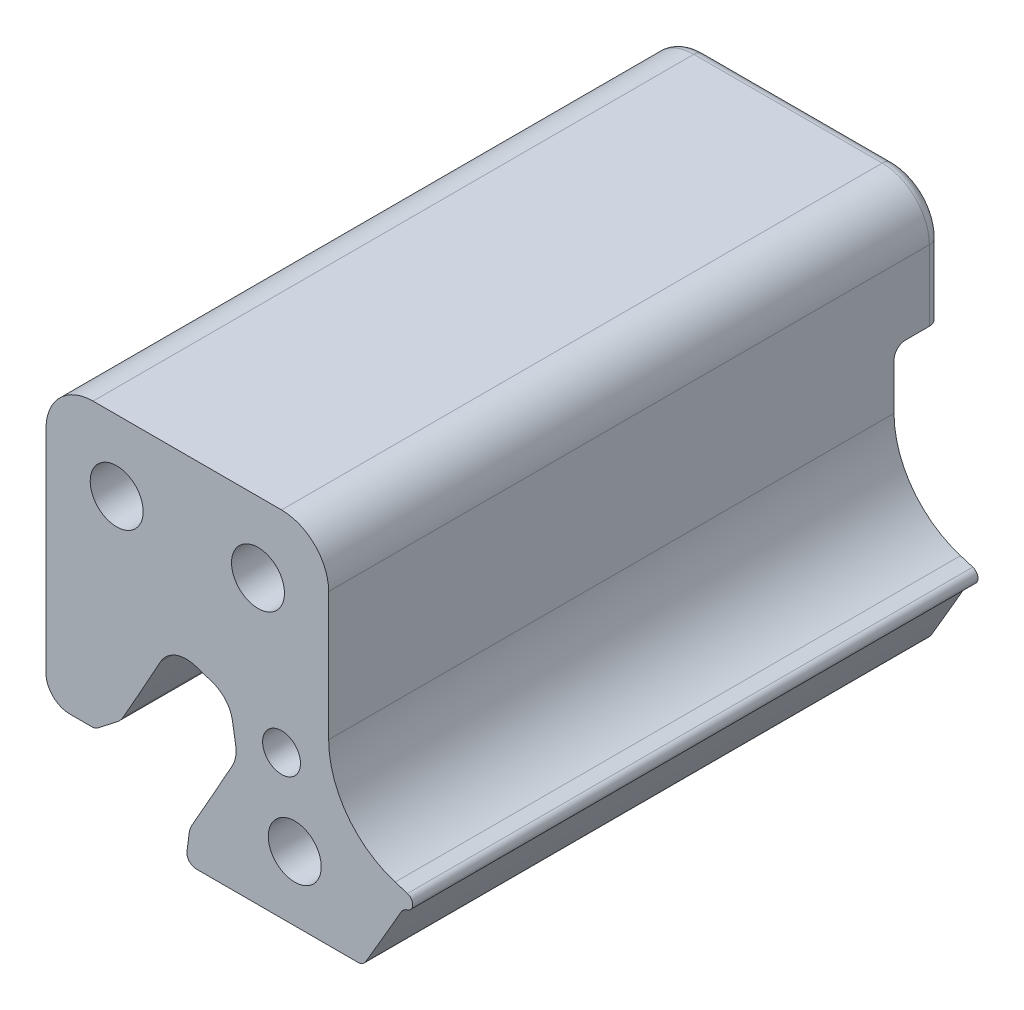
ISO-10303-21;
HEADER;
FILE_DESCRIPTION(('STEP AP214'),'2;1');
FILE_NAME('part.step','',(''),(''),'','','');
FILE_SCHEMA(('AUTOMOTIVE_DESIGN { 1 0 10303 214 1 1 1 1 }'));
ENDSEC;
DATA;
#1=APPLICATION_CONTEXT('core data for automotive mechanical design processes');
#2=APPLICATION_PROTOCOL_DEFINITION('international standard','automotive_design',2000,#1);
#3=PRODUCT_CONTEXT('',#1,'mechanical');
#4=PRODUCT('Part','Part','',(#3));
#5=PRODUCT_RELATED_PRODUCT_CATEGORY('part','',(#4));
#6=PRODUCT_DEFINITION_FORMATION('','',#4);
#7=PRODUCT_DEFINITION_CONTEXT('part definition',#1,'design');
#8=PRODUCT_DEFINITION('design','',#6,#7);
#9=PRODUCT_DEFINITION_SHAPE('','',#8);
#10=(LENGTH_UNIT() NAMED_UNIT(*) SI_UNIT(.MILLI.,.METRE.));
#11=(NAMED_UNIT(*) PLANE_ANGLE_UNIT() SI_UNIT($,.RADIAN.));
#12=(NAMED_UNIT(*) SI_UNIT($,.STERADIAN.) SOLID_ANGLE_UNIT());
#13=UNCERTAINTY_MEASURE_WITH_UNIT(LENGTH_MEASURE(1.E-05),#10,'distance_accuracy_value','');
#14=(GEOMETRIC_REPRESENTATION_CONTEXT(3) GLOBAL_UNCERTAINTY_ASSIGNED_CONTEXT((#13)) GLOBAL_UNIT_ASSIGNED_CONTEXT((#10,
#11,#12)) REPRESENTATION_CONTEXT('',''));
#15=CARTESIAN_POINT('',(0.,0.,0.));
#16=DIRECTION('',(0.,0.,1.));
#17=DIRECTION('',(1.,0.,0.));
#18=AXIS2_PLACEMENT_3D('',#15,#16,#17);
#19=CARTESIAN_POINT('',(-834.771,98.1709999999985,-9.00429999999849));
#20=DIRECTION('',(0.,0.,0.999999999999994));
#21=DIRECTION('',(1.,0.,0.));
#22=AXIS2_PLACEMENT_3D('',#19,#20,#21);
#23=TOROIDAL_SURFACE('',#22,4.76249999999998,1.5875);
#24=CARTESIAN_POINT('',(-830.0085,98.1709999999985,-9.00429999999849));
#25=DIRECTION('',(0.,-1.00000000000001,0.));
#26=DIRECTION('',(1.,0.,0.));
#27=AXIS2_PLACEMENT_3D('',#24,#25,#26);
#28=CIRCLE('',#27,1.5875);
#29=CARTESIAN_POINT('',(-830.0085,98.1709999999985,-10.5917999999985));
#30=VERTEX_POINT('',#29);
#31=CARTESIAN_POINT('',(-828.421,98.1709999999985,-9.00429999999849));
#32=VERTEX_POINT('',#31);
#33=EDGE_CURVE('E12',#30,#32,#28,.T.);
#34=ORIENTED_EDGE('',*,*,#33,.F.);
#35=CARTESIAN_POINT('',(-834.771,98.1709999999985,-10.5917999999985));
#36=DIRECTION('',(0.,0.,0.999999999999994));
#37=DIRECTION('',(1.,0.,0.));
#38=AXIS2_PLACEMENT_3D('',#35,#36,#37);
#39=CIRCLE('',#38,4.76249999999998);
#40=CARTESIAN_POINT('',(-834.771,102.933499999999,-10.5917999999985));
#41=VERTEX_POINT('',#40);
#42=EDGE_CURVE('E358',#41,#30,#39,.F.);
#43=ORIENTED_EDGE('',*,*,#42,.F.);
#44=CARTESIAN_POINT('',(-834.771,102.933499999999,-9.00429999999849));
#45=DIRECTION('',(1.,0.,0.));
#46=DIRECTION('',(0.,0.,-0.999999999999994));
#47=AXIS2_PLACEMENT_3D('',#44,#45,#46);
#48=CIRCLE('',#47,1.5875);
#49=CARTESIAN_POINT('',(-834.771,104.520999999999,-9.00429999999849));
#50=VERTEX_POINT('',#49);
#51=EDGE_CURVE('E69',#41,#50,#48,.T.);
#52=ORIENTED_EDGE('',*,*,#51,.T.);
#53=CARTESIAN_POINT('',(-834.771,98.1709999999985,-9.00429999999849));
#54=DIRECTION('',(0.,0.,0.999999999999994));
#55=DIRECTION('',(1.,0.,0.));
#56=AXIS2_PLACEMENT_3D('',#53,#54,#55);
#57=CIRCLE('',#56,6.34999999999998);
#58=EDGE_CURVE('E381',#32,#50,#57,.T.);
#59=ORIENTED_EDGE('',*,*,#58,.F.);
#60=EDGE_LOOP('',(#34,#43,#52,#59));
#61=FACE_BOUND('',#60,.T.);
#62=ADVANCED_FACE('F58',(#61),#23,.T.);
#63=CARTESIAN_POINT('',(-824.511080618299,102.933499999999,-9.00429999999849));
#64=DIRECTION('',(1.,0.,0.));
#65=DIRECTION('',(0.,0.,-0.999999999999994));
#66=AXIS2_PLACEMENT_3D('',#63,#64,#65);
#67=CYLINDRICAL_SURFACE('',#66,1.5875);
#68=ORIENTED_EDGE('',*,*,#51,.F.);
#69=DIRECTION('',(1.,0.,0.));
#70=VECTOR('',#69,1.);
#71=CARTESIAN_POINT('',(-824.511080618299,102.933499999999,-10.5917999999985));
#72=LINE('',#71,#70);
#73=CARTESIAN_POINT('',(-860.171,102.933499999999,-10.5917999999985));
#74=VERTEX_POINT('',#73);
#75=EDGE_CURVE('E892',#74,#41,#72,.T.);
#76=ORIENTED_EDGE('',*,*,#75,.F.);
#77=CARTESIAN_POINT('',(-860.171,102.933499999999,-9.00429999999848));
#78=DIRECTION('',(1.,0.,0.));
#79=DIRECTION('',(0.,0.,-0.999999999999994));
#80=AXIS2_PLACEMENT_3D('',#77,#78,#79);
#81=CIRCLE('',#80,1.5875);
#82=CARTESIAN_POINT('',(-860.171,104.520999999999,-9.00429999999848));
#83=VERTEX_POINT('',#82);
#84=EDGE_CURVE('E372',#74,#83,#81,.T.);
#85=ORIENTED_EDGE('',*,*,#84,.T.);
#86=DIRECTION('',(1.,0.,0.));
#87=VECTOR('',#86,1.);
#88=CARTESIAN_POINT('',(-834.771,104.520999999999,-9.00429999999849));
#89=LINE('',#88,#87);
#90=EDGE_CURVE('E385',#50,#83,#89,.F.);
#91=ORIENTED_EDGE('',*,*,#90,.F.);
#92=EDGE_LOOP('',(#68,#76,#85,#91));
#93=FACE_BOUND('',#92,.T.);
#94=ADVANCED_FACE('F899',(#93),#67,.T.);
#95=CARTESIAN_POINT('',(-860.171,98.1709999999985,-9.00429999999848));
#96=DIRECTION('',(0.,0.,0.999999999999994));
#97=DIRECTION('',(1.,0.,0.));
#98=AXIS2_PLACEMENT_3D('',#95,#96,#97);
#99=TOROIDAL_SURFACE('',#98,4.76250000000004,1.5875);
#100=ORIENTED_EDGE('',*,*,#84,.F.);
#101=CARTESIAN_POINT('',(-860.171,98.1709999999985,-10.5917999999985));
#102=DIRECTION('',(0.,0.,0.999999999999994));
#103=DIRECTION('',(1.,0.,0.));
#104=AXIS2_PLACEMENT_3D('',#101,#102,#103);
#105=CIRCLE('',#104,4.76250000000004);
#106=CARTESIAN_POINT('',(-864.9335,98.1709999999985,-10.5917999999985));
#107=VERTEX_POINT('',#106);
#108=EDGE_CURVE('E540',#107,#74,#105,.F.);
#109=ORIENTED_EDGE('',*,*,#108,.F.);
#110=CARTESIAN_POINT('',(-864.9335,98.1709999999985,-9.00429999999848));
#111=DIRECTION('',(0.,1.00000000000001,0.));
#112=DIRECTION('',(-1.,0.,0.));
#113=AXIS2_PLACEMENT_3D('',#110,#111,#112);
#114=CIRCLE('',#113,1.5875);
#115=CARTESIAN_POINT('',(-866.521,98.1709999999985,-9.00429999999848));
#116=VERTEX_POINT('',#115);
#117=EDGE_CURVE('E374',#107,#116,#114,.T.);
#118=ORIENTED_EDGE('',*,*,#117,.T.);
#119=CARTESIAN_POINT('',(-860.171,98.1709999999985,-9.00429999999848));
#120=DIRECTION('',(0.,0.,0.999999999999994));
#121=DIRECTION('',(1.,0.,0.));
#122=AXIS2_PLACEMENT_3D('',#119,#120,#121);
#123=CIRCLE('',#122,6.35000000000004);
#124=EDGE_CURVE('E524',#83,#116,#123,.T.);
#125=ORIENTED_EDGE('',*,*,#124,.F.);
#126=EDGE_LOOP('',(#100,#109,#118,#125));
#127=FACE_BOUND('',#126,.T.);
#128=ADVANCED_FACE('F919',(#127),#99,.T.);
#129=CARTESIAN_POINT('',(-864.9335,58.1234614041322,-9.00429999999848));
#130=DIRECTION('',(0.,1.00000000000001,0.));
#131=DIRECTION('',(-1.,0.,0.));
#132=AXIS2_PLACEMENT_3D('',#129,#130,#131);
#133=CYLINDRICAL_SURFACE('',#132,1.5875);
#134=ORIENTED_EDGE('',*,*,#117,.F.);
#135=DIRECTION('',(0.,1.00000000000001,0.));
#136=VECTOR('',#135,1.);
#137=CARTESIAN_POINT('',(-864.9335,58.1234614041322,-10.5917999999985));
#138=LINE('',#137,#136);
#139=CARTESIAN_POINT('',(-864.9335,88.6460000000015,-10.5917999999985));
#140=VERTEX_POINT('',#139);
#141=EDGE_CURVE('E534',#140,#107,#138,.T.);
#142=ORIENTED_EDGE('',*,*,#141,.F.);
#143=CARTESIAN_POINT('',(-864.9335,88.6460000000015,-9.00429999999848));
#144=DIRECTION('',(0.,-1.00000000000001,0.));
#145=DIRECTION('',(1.,0.,0.));
#146=AXIS2_PLACEMENT_3D('',#143,#144,#145);
#147=CIRCLE('',#146,1.5875);
#148=CARTESIAN_POINT('',(-866.521,88.6460000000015,-9.00429999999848));
#149=VERTEX_POINT('',#148);
#150=EDGE_CURVE('E528',#149,#140,#147,.T.);
#151=ORIENTED_EDGE('',*,*,#150,.F.);
#152=DIRECTION('',(0.,1.00000000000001,0.));
#153=VECTOR('',#152,1.);
#154=CARTESIAN_POINT('',(-866.521,69.5959999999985,-9.00429999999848));
#155=LINE('',#154,#153);
#156=EDGE_CURVE('E518',#116,#149,#155,.F.);
#157=ORIENTED_EDGE('',*,*,#156,.F.);
#158=EDGE_LOOP('',(#134,#142,#151,#157));
#159=FACE_BOUND('',#158,.T.);
#160=ADVANCED_FACE('F530',(#159),#133,.T.);
#161=CARTESIAN_POINT('',(-830.0085,58.1234614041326,-9.00429999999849));
#162=DIRECTION('',(0.,-1.00000000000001,0.));
#163=DIRECTION('',(1.,0.,0.));
#164=AXIS2_PLACEMENT_3D('',#161,#162,#163);
#165=CYLINDRICAL_SURFACE('',#164,1.5875);
#166=DIRECTION('',(0.,-1.00000000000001,0.));
#167=VECTOR('',#166,1.);
#168=CARTESIAN_POINT('',(-830.0085,58.1234614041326,-10.5917999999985));
#169=LINE('',#168,#167);
#170=CARTESIAN_POINT('',(-830.0085,88.6460000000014,-10.5917999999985));
#171=VERTEX_POINT('',#170);
#172=EDGE_CURVE('E353',#30,#171,#169,.T.);
#173=ORIENTED_EDGE('',*,*,#172,.F.);
#174=ORIENTED_EDGE('',*,*,#33,.T.);
#175=DIRECTION('',(0.,-1.00000000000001,0.));
#176=VECTOR('',#175,1.);
#177=CARTESIAN_POINT('',(-828.421,98.1709999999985,-9.00429999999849));
#178=LINE('',#177,#176);
#179=CARTESIAN_POINT('',(-828.421,88.6460000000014,-9.00429999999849));
#180=VERTEX_POINT('',#179);
#181=EDGE_CURVE('E378',#180,#32,#178,.F.);
#182=ORIENTED_EDGE('',*,*,#181,.F.);
#183=CARTESIAN_POINT('',(-830.0085,88.6460000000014,-9.00429999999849));
#184=DIRECTION('',(0.,-1.00000000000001,0.));
#185=DIRECTION('',(1.,0.,0.));
#186=AXIS2_PLACEMENT_3D('',#183,#184,#185);
#187=CIRCLE('',#186,1.5875);
#188=EDGE_CURVE('E282',#171,#180,#187,.T.);
#189=ORIENTED_EDGE('',*,*,#188,.F.);
#190=EDGE_LOOP('',(#173,#174,#182,#189));
#191=FACE_BOUND('',#190,.T.);
#192=ADVANCED_FACE('F60',(#191),#165,.T.);
#193=CARTESIAN_POINT('',(-824.511080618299,58.1234614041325,71.9582));
#194=DIRECTION('',(0.,0.,-0.999999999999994));
#195=DIRECTION('',(-1.,0.,0.));
#196=AXIS2_PLACEMENT_3D('',#193,#194,#195);
#197=CYLINDRICAL_SURFACE('',#196,1.27000000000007);
#198=CARTESIAN_POINT('',(-824.511080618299,58.1234614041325,-4.2417999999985));
#199=DIRECTION('',(0.,0.,-0.999999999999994));
#200=DIRECTION('',(0.,1.00000000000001,0.));
#201=AXIS2_PLACEMENT_3D('',#198,#199,#200);
#202=CIRCLE('',#201,1.27000000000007);
#203=CARTESIAN_POINT('',(-823.417312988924,57.4780372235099,-4.2417999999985));
#204=VERTEX_POINT('',#203);
#205=CARTESIAN_POINT('',(-824.511080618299,56.8534614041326,-4.2417999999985));
#206=VERTEX_POINT('',#205);
#207=EDGE_CURVE('E588',#204,#206,#202,.T.);
#208=ORIENTED_EDGE('',*,*,#207,.F.);
#209=DIRECTION('',(0.,0.,-0.999999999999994));
#210=VECTOR('',#209,1.);
#211=CARTESIAN_POINT('',(-823.417312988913,57.4780372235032,71.9582));
#212=LINE('',#211,#210);
#213=CARTESIAN_POINT('',(-823.417312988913,57.4780372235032,71.9582));
#214=VERTEX_POINT('',#213);
#215=EDGE_CURVE('E338',#214,#204,#212,.T.);
#216=ORIENTED_EDGE('',*,*,#215,.F.);
#217=CARTESIAN_POINT('',(-824.511080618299,58.1234614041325,71.9582));
#218=DIRECTION('',(0.,0.,0.999999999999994));
#219=DIRECTION('',(1.,0.,0.));
#220=AXIS2_PLACEMENT_3D('',#217,#218,#219);
#221=CIRCLE('',#220,1.27000000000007);
#222=CARTESIAN_POINT('',(-824.511080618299,56.8534614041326,71.9582));
#223=VERTEX_POINT('',#222);
#224=EDGE_CURVE('E304',#223,#214,#221,.T.);
#225=ORIENTED_EDGE('',*,*,#224,.F.);
#226=DIRECTION('',(0.,0.,-0.999999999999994));
#227=VECTOR('',#226,1.);
#228=CARTESIAN_POINT('',(-824.511080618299,56.8534614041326,71.9582));
#229=LINE('',#228,#227);
#230=EDGE_CURVE('E773',#223,#206,#229,.T.);
#231=ORIENTED_EDGE('',*,*,#230,.T.);
#232=EDGE_LOOP('',(#208,#216,#225,#231));
#233=FACE_BOUND('',#232,.T.);
#234=ADVANCED_FACE('F833',(#233),#197,.T.);
#235=CARTESIAN_POINT('',(-1552.31646147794,487.596028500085,71.9582000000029));
#236=DIRECTION('',(0.,0.,-0.999999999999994));
#237=DIRECTION('',(-1.,0.,0.));
#238=AXIS2_PLACEMENT_3D('',#235,#236,#237);
#239=CYLINDRICAL_SURFACE('',#238,846.342398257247);
#240=CARTESIAN_POINT('',(-1552.31646147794,487.596028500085,-4.24179999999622));
#241=DIRECTION('',(0.,0.,-0.999999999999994));
#242=DIRECTION('',(0.,1.00000000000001,0.));
#243=AXIS2_PLACEMENT_3D('',#240,#241,#242);
#244=CIRCLE('',#243,846.342398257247);
#245=CARTESIAN_POINT('',(-818.671206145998,65.6243536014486,-4.2417999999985));
#246=VERTEX_POINT('',#245);
#247=EDGE_CURVE('E585',#246,#204,#244,.T.);
#248=ORIENTED_EDGE('',*,*,#247,.F.);
#249=DIRECTION('',(0.,0.,-0.999999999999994));
#250=VECTOR('',#249,1.);
#251=CARTESIAN_POINT('',(-818.671206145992,65.6243536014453,71.9582000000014));
#252=LINE('',#251,#250);
#253=CARTESIAN_POINT('',(-818.671206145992,65.6243536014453,71.9582000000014));
#254=VERTEX_POINT('',#253);
#255=EDGE_CURVE('E333',#254,#246,#252,.T.);
#256=ORIENTED_EDGE('',*,*,#255,.F.);
#257=CARTESIAN_POINT('',(-1552.31646147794,487.596028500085,71.9582000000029));
#258=DIRECTION('',(0.,0.,0.999999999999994));
#259=DIRECTION('',(1.,0.,0.));
#260=AXIS2_PLACEMENT_3D('',#257,#258,#259);
#261=CIRCLE('',#260,846.342398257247);
#262=EDGE_CURVE('E310',#214,#254,#261,.T.);
#263=ORIENTED_EDGE('',*,*,#262,.F.);
#264=ORIENTED_EDGE('',*,*,#215,.T.);
#265=EDGE_LOOP('',(#248,#256,#263,#264));
#266=FACE_BOUND('',#265,.T.);
#267=ADVANCED_FACE('F836',(#266),#239,.T.);
#268=CARTESIAN_POINT('',(-817.35013872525,64.8645135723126,71.9582000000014));
#269=DIRECTION('',(0.,0.,-0.999999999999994));
#270=DIRECTION('',(-1.,0.,0.));
#271=AXIS2_PLACEMENT_3D('',#268,#269,#270);
#272=CYLINDRICAL_SURFACE('',#271,1.524000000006);
#273=CARTESIAN_POINT('',(-817.35013872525,64.8645135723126,-4.2417999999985));
#274=DIRECTION('',(0.,0.,-0.999999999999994));
#275=DIRECTION('',(0.,1.00000000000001,0.));
#276=AXIS2_PLACEMENT_3D('',#273,#274,#275);
#277=CIRCLE('',#276,1.524000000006);
#278=CARTESIAN_POINT('',(-817.801862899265,66.3200276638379,-4.2417999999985));
#279=VERTEX_POINT('',#278);
#280=EDGE_CURVE('E582',#279,#246,#277,.F.);
#281=ORIENTED_EDGE('',*,*,#280,.F.);
#282=DIRECTION('',(0.,0.,-0.999999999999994));
#283=VECTOR('',#282,1.);
#284=CARTESIAN_POINT('',(-817.801862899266,66.3200276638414,71.9582000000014));
#285=LINE('',#284,#283);
#286=CARTESIAN_POINT('',(-817.801862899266,66.3200276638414,71.9582000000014));
#287=VERTEX_POINT('',#286);
#288=EDGE_CURVE('E339',#287,#279,#285,.T.);
#289=ORIENTED_EDGE('',*,*,#288,.F.);
#290=CARTESIAN_POINT('',(-817.35013872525,64.8645135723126,71.9582000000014));
#291=DIRECTION('',(0.,0.,-0.999999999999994));
#292=DIRECTION('',(1.,0.,0.));
#293=AXIS2_PLACEMENT_3D('',#290,#291,#292);
#294=CIRCLE('',#293,1.524000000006);
#295=EDGE_CURVE('E318',#254,#287,#294,.T.);
#296=ORIENTED_EDGE('',*,*,#295,.F.);
#297=ORIENTED_EDGE('',*,*,#255,.T.);
#298=EDGE_LOOP('',(#281,#289,#296,#297));
#299=FACE_BOUND('',#298,.T.);
#300=ADVANCED_FACE('F841',(#299),#272,.F.);
#301=CARTESIAN_POINT('',(-818.09826983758,67.2750894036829,71.9582000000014));
#302=DIRECTION('',(0.,0.,-0.999999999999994));
#303=DIRECTION('',(-1.,0.,0.));
#304=AXIS2_PLACEMENT_3D('',#301,#302,#303);
#305=CYLINDRICAL_SURFACE('',#304,0.999999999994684);
#306=CARTESIAN_POINT('',(-818.09826983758,67.2750894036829,-4.2417999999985));
#307=DIRECTION('',(0.,0.,-0.999999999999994));
#308=DIRECTION('',(0.,1.00000000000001,0.));
#309=AXIS2_PLACEMENT_3D('',#306,#307,#308);
#310=CIRCLE('',#309,0.999999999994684);
#311=CARTESIAN_POINT('',(-817.804230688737,68.2308827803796,-4.2417999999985));
#312=VERTEX_POINT('',#311);
#313=EDGE_CURVE('E577',#312,#279,#310,.T.);
#314=ORIENTED_EDGE('',*,*,#313,.F.);
#315=DIRECTION('',(0.,0.,-0.999999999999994));
#316=VECTOR('',#315,1.);
#317=CARTESIAN_POINT('',(-817.804230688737,68.2308827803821,71.9582000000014));
#318=LINE('',#317,#316);
#319=CARTESIAN_POINT('',(-817.804230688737,68.2308827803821,71.9582000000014));
#320=VERTEX_POINT('',#319);
#321=EDGE_CURVE('E850',#320,#312,#318,.T.);
#322=ORIENTED_EDGE('',*,*,#321,.F.);
#323=CARTESIAN_POINT('',(-818.09826983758,67.2750894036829,71.9582000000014));
#324=DIRECTION('',(0.,0.,0.999999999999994));
#325=DIRECTION('',(-1.,0.,0.));
#326=AXIS2_PLACEMENT_3D('',#323,#324,#325);
#327=CIRCLE('',#326,0.999999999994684);
#328=EDGE_CURVE('E322',#287,#320,#327,.T.);
#329=ORIENTED_EDGE('',*,*,#328,.F.);
#330=ORIENTED_EDGE('',*,*,#288,.T.);
#331=EDGE_LOOP('',(#314,#322,#329,#330));
#332=FACE_BOUND('',#331,.T.);
#333=ADVANCED_FACE('F851',(#332),#305,.T.);
#334=CARTESIAN_POINT('',(-817.804230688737,68.2308827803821,71.9582000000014));
#335=DIRECTION('',(-0.294039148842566,-0.955793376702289,0.));
#336=DIRECTION('',(0.955793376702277,-0.294039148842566,0.));
#337=AXIS2_PLACEMENT_3D('',#334,#335,#336);
#338=PLANE('',#337);
#339=DIRECTION('',(0.955793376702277,-0.294039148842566,0.));
#340=VECTOR('',#339,1.);
#341=CARTESIAN_POINT('',(-817.804230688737,68.2308827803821,-4.2417999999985));
#342=LINE('',#341,#340);
#343=CARTESIAN_POINT('',(-819.455297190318,68.7388149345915,-4.2417999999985));
#344=VERTEX_POINT('',#343);
#345=EDGE_CURVE('E574',#344,#312,#342,.T.);
#346=ORIENTED_EDGE('',*,*,#345,.F.);
#347=DIRECTION('',(0.,0.,-0.999999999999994));
#348=VECTOR('',#347,1.);
#349=CARTESIAN_POINT('',(-819.455297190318,68.7388149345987,71.9582000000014));
#350=LINE('',#349,#348);
#351=CARTESIAN_POINT('',(-819.455297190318,68.7388149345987,71.9582000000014));
#352=VERTEX_POINT('',#351);
#353=EDGE_CURVE('E415',#352,#344,#350,.T.);
#354=ORIENTED_EDGE('',*,*,#353,.F.);
#355=DIRECTION('',(-0.955793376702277,0.294039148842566,0.));
#356=VECTOR('',#355,1.);
#357=CARTESIAN_POINT('',(-817.804230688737,68.2308827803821,71.9582000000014));
#358=LINE('',#357,#356);
#359=EDGE_CURVE('E426',#320,#352,#358,.T.);
#360=ORIENTED_EDGE('',*,*,#359,.F.);
#361=ORIENTED_EDGE('',*,*,#321,.T.);
#362=EDGE_LOOP('',(#346,#354,#360,#361));
#363=FACE_BOUND('',#362,.T.);
#364=ADVANCED_FACE('F854',(#363),#338,.F.);
#365=CARTESIAN_POINT('',(-815.721,80.8773908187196,71.9582000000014));
#366=DIRECTION('',(0.,0.,-0.999999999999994));
#367=DIRECTION('',(-1.,0.,0.));
#368=AXIS2_PLACEMENT_3D('',#365,#366,#367);
#369=CYLINDRICAL_SURFACE('',#368,12.700000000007);
#370=CARTESIAN_POINT('',(-815.721,80.8773908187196,-4.2417999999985));
#371=DIRECTION('',(0.,0.,-0.999999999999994));
#372=DIRECTION('',(0.,1.00000000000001,0.));
#373=AXIS2_PLACEMENT_3D('',#370,#371,#372);
#374=CIRCLE('',#373,12.700000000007);
#375=CARTESIAN_POINT('',(-828.421000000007,80.877390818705,-4.2417999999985));
#376=VERTEX_POINT('',#375);
#377=EDGE_CURVE('E312',#376,#344,#374,.F.);
#378=ORIENTED_EDGE('',*,*,#377,.F.);
#379=DIRECTION('',(0.,0.,-0.999999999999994));
#380=VECTOR('',#379,1.);
#381=CARTESIAN_POINT('',(-828.421,80.877390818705,71.9582000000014));
#382=LINE('',#381,#380);
#383=CARTESIAN_POINT('',(-828.421,80.877390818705,71.9582000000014));
#384=VERTEX_POINT('',#383);
#385=EDGE_CURVE('E411',#384,#376,#382,.T.);
#386=ORIENTED_EDGE('',*,*,#385,.F.);
#387=CARTESIAN_POINT('',(-815.721,80.8773908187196,71.9582000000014));
#388=DIRECTION('',(0.,0.,-0.999999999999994));
#389=DIRECTION('',(-1.,0.,0.));
#390=AXIS2_PLACEMENT_3D('',#387,#388,#389);
#391=CIRCLE('',#390,12.700000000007);
#392=EDGE_CURVE('E421',#352,#384,#391,.T.);
#393=ORIENTED_EDGE('',*,*,#392,.F.);
#394=ORIENTED_EDGE('',*,*,#353,.T.);
#395=EDGE_LOOP('',(#378,#386,#393,#394));
#396=FACE_BOUND('',#395,.T.);
#397=ADVANCED_FACE('F568',(#396),#369,.F.);
#398=CARTESIAN_POINT('',(-828.421,98.1709999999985,71.9582000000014));
#399=DIRECTION('',(-1.,0.,0.));
#400=DIRECTION('',(0.,-1.00000000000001,0.));
#401=AXIS2_PLACEMENT_3D('',#398,#399,#400);
#402=PLANE('',#401);
#403=DIRECTION('',(0.,0.,0.999999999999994));
#404=VECTOR('',#403,1.);
#405=CARTESIAN_POINT('',(-828.421,88.6460000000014,71.9582000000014));
#406=LINE('',#405,#404);
#407=CARTESIAN_POINT('',(-828.421,88.6460000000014,-5.8292999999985));
#408=VERTEX_POINT('',#407);
#409=EDGE_CURVE('E275',#180,#408,#406,.T.);
#410=ORIENTED_EDGE('',*,*,#409,.F.);
#411=ORIENTED_EDGE('',*,*,#181,.T.);
#412=DIRECTION('',(0.,0.,-0.999999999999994));
#413=VECTOR('',#412,1.);
#414=CARTESIAN_POINT('',(-828.421,98.1709999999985,71.9582000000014));
#415=LINE('',#414,#413);
#416=CARTESIAN_POINT('',(-828.421,98.1709999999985,71.9582000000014));
#417=VERTEX_POINT('',#416);
#418=EDGE_CURVE('E406',#417,#32,#415,.T.);
#419=ORIENTED_EDGE('',*,*,#418,.F.);
#420=DIRECTION('',(0.,1.00000000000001,0.));
#421=VECTOR('',#420,1.);
#422=CARTESIAN_POINT('',(-828.421,98.1709999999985,71.9582000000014));
#423=LINE('',#422,#421);
#424=EDGE_CURVE('E425',#384,#417,#423,.T.);
#425=ORIENTED_EDGE('',*,*,#424,.F.);
#426=ORIENTED_EDGE('',*,*,#385,.T.);
#427=DIRECTION('',(0.,-1.00000000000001,0.));
#428=VECTOR('',#427,1.);
#429=CARTESIAN_POINT('',(-828.421,98.1709999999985,-4.2417999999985));
#430=LINE('',#429,#428);
#431=CARTESIAN_POINT('',(-828.421,87.0585000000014,-4.2417999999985));
#432=VERTEX_POINT('',#431);
#433=EDGE_CURVE('E302',#432,#376,#430,.T.);
#434=ORIENTED_EDGE('',*,*,#433,.F.);
#435=CARTESIAN_POINT('',(-828.421,87.0585000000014,-5.8292999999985));
#436=DIRECTION('',(-1.,0.,0.));
#437=DIRECTION('',(0.,-1.00000000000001,0.));
#438=AXIS2_PLACEMENT_3D('',#435,#436,#437);
#439=CIRCLE('',#438,1.5875);
#440=EDGE_CURVE('E292',#408,#432,#439,.F.);
#441=ORIENTED_EDGE('',*,*,#440,.F.);
#442=EDGE_LOOP('',(#410,#411,#419,#425,#426,#434,#441));
#443=FACE_BOUND('',#442,.T.);
#444=ADVANCED_FACE('F300',(#443),#402,.F.);
#445=CARTESIAN_POINT('',(-866.521,69.5959999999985,71.9582000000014));
#446=DIRECTION('',(1.,0.,0.));
#447=DIRECTION('',(0.,1.00000000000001,0.));
#448=AXIS2_PLACEMENT_3D('',#445,#446,#447);
#449=PLANE('',#448);
#450=DIRECTION('',(0.,0.,-0.999999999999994));
#451=VECTOR('',#450,1.);
#452=CARTESIAN_POINT('',(-866.521,98.1709999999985,71.9582000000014));
#453=LINE('',#452,#451);
#454=CARTESIAN_POINT('',(-866.521,98.1709999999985,71.9582000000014));
#455=VERTEX_POINT('',#454);
#456=EDGE_CURVE('E402',#455,#116,#453,.T.);
#457=ORIENTED_EDGE('',*,*,#456,.T.);
#458=ORIENTED_EDGE('',*,*,#156,.T.);
#459=DIRECTION('',(0.,0.,-0.999999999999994));
#460=VECTOR('',#459,1.);
#461=CARTESIAN_POINT('',(-866.521,88.6460000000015,71.9582000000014));
#462=LINE('',#461,#460);
#463=CARTESIAN_POINT('',(-866.521,88.6460000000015,-5.82929999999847));
#464=VERTEX_POINT('',#463);
#465=EDGE_CURVE('E287',#464,#149,#462,.T.);
#466=ORIENTED_EDGE('',*,*,#465,.F.);
#467=CARTESIAN_POINT('',(-866.521,87.0585000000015,-5.82929999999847));
#468=DIRECTION('',(1.,0.,0.));
#469=DIRECTION('',(0.,1.00000000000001,0.));
#470=AXIS2_PLACEMENT_3D('',#467,#468,#469);
#471=CIRCLE('',#470,1.5875);
#472=CARTESIAN_POINT('',(-866.521,87.0585000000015,-4.24179999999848));
#473=VERTEX_POINT('',#472);
#474=EDGE_CURVE('E295',#473,#464,#471,.F.);
#475=ORIENTED_EDGE('',*,*,#474,.F.);
#476=DIRECTION('',(0.,1.00000000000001,0.));
#477=VECTOR('',#476,1.);
#478=CARTESIAN_POINT('',(-866.521,69.5959999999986,-4.24179999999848));
#479=LINE('',#478,#477);
#480=CARTESIAN_POINT('',(-866.521,69.5959999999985,-4.24179999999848));
#481=VERTEX_POINT('',#480);
#482=EDGE_CURVE('E592',#481,#473,#479,.T.);
#483=ORIENTED_EDGE('',*,*,#482,.F.);
#484=DIRECTION('',(0.,0.,-0.999999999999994));
#485=VECTOR('',#484,1.);
#486=CARTESIAN_POINT('',(-866.521,69.5959999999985,71.9582000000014));
#487=LINE('',#486,#485);
#488=CARTESIAN_POINT('',(-866.521,69.5959999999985,71.9582000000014));
#489=VERTEX_POINT('',#488);
#490=EDGE_CURVE('E501',#489,#481,#487,.T.);
#491=ORIENTED_EDGE('',*,*,#490,.F.);
#492=DIRECTION('',(0.,-1.00000000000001,0.));
#493=VECTOR('',#492,1.);
#494=CARTESIAN_POINT('',(-866.521,69.5959999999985,71.9582000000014));
#495=LINE('',#494,#493);
#496=EDGE_CURVE('E438',#455,#489,#495,.T.);
#497=ORIENTED_EDGE('',*,*,#496,.F.);
#498=EDGE_LOOP('',(#457,#458,#466,#475,#483,#491,#497));
#499=FACE_BOUND('',#498,.T.);
#500=ADVANCED_FACE('F516',(#499),#449,.F.);
#501=CARTESIAN_POINT('',(-863.346,69.5959999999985,71.9582000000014));
#502=DIRECTION('',(0.,0.,-0.999999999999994));
#503=DIRECTION('',(-1.,0.,0.));
#504=AXIS2_PLACEMENT_3D('',#501,#502,#503);
#505=CYLINDRICAL_SURFACE('',#504,3.17499999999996);
#506=CARTESIAN_POINT('',(-863.346,69.5959999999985,-4.2417999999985));
#507=DIRECTION('',(0.,0.,-0.999999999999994));
#508=DIRECTION('',(0.,1.00000000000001,0.));
#509=AXIS2_PLACEMENT_3D('',#506,#507,#508);
#510=CIRCLE('',#509,3.17499999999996);
#511=CARTESIAN_POINT('',(-863.346,66.4209999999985,-4.2417999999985));
#512=VERTEX_POINT('',#511);
#513=EDGE_CURVE('E595',#512,#481,#510,.T.);
#514=ORIENTED_EDGE('',*,*,#513,.F.);
#515=DIRECTION('',(0.,0.,-0.999999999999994));
#516=VECTOR('',#515,1.);
#517=CARTESIAN_POINT('',(-863.346,66.4209999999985,71.9582000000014));
#518=LINE('',#517,#516);
#519=CARTESIAN_POINT('',(-863.346,66.4209999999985,71.9582000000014));
#520=VERTEX_POINT('',#519);
#521=EDGE_CURVE('E498',#520,#512,#518,.T.);
#522=ORIENTED_EDGE('',*,*,#521,.F.);
#523=CARTESIAN_POINT('',(-863.346,69.5959999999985,71.9582000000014));
#524=DIRECTION('',(0.,0.,0.999999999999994));
#525=DIRECTION('',(1.,0.,0.));
#526=AXIS2_PLACEMENT_3D('',#523,#524,#525);
#527=CIRCLE('',#526,3.17499999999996);
#528=EDGE_CURVE('E441',#489,#520,#527,.T.);
#529=ORIENTED_EDGE('',*,*,#528,.F.);
#530=ORIENTED_EDGE('',*,*,#490,.T.);
#531=EDGE_LOOP('',(#514,#522,#529,#530));
#532=FACE_BOUND('',#531,.T.);
#533=ADVANCED_FACE('F685',(#532),#505,.T.);
#534=CARTESIAN_POINT('',(-863.346,66.4209999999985,71.9582000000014));
#535=DIRECTION('',(0.,1.00000000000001,0.));
#536=DIRECTION('',(-1.,0.,0.));
#537=AXIS2_PLACEMENT_3D('',#534,#535,#536);
#538=PLANE('',#537);
#539=DIRECTION('',(-1.,0.,0.));
#540=VECTOR('',#539,1.);
#541=CARTESIAN_POINT('',(-863.346,66.4209999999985,-4.2417999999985));
#542=LINE('',#541,#540);
#543=CARTESIAN_POINT('',(-860.311584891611,66.4209999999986,-4.2417999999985));
#544=VERTEX_POINT('',#543);
#545=EDGE_CURVE('E599',#544,#512,#542,.T.);
#546=ORIENTED_EDGE('',*,*,#545,.F.);
#547=DIRECTION('',(0.,0.,-0.999999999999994));
#548=VECTOR('',#547,1.);
#549=CARTESIAN_POINT('',(-860.311584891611,66.4209999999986,71.9582000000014));
#550=LINE('',#549,#548);
#551=CARTESIAN_POINT('',(-860.311584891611,66.4209999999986,71.9582000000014));
#552=VERTEX_POINT('',#551);
#553=EDGE_CURVE('E494',#552,#544,#550,.T.);
#554=ORIENTED_EDGE('',*,*,#553,.F.);
#555=DIRECTION('',(1.,0.,0.));
#556=VECTOR('',#555,1.);
#557=CARTESIAN_POINT('',(-863.346,66.4209999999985,71.9582000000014));
#558=LINE('',#557,#556);
#559=EDGE_CURVE('E444',#520,#552,#558,.T.);
#560=ORIENTED_EDGE('',*,*,#559,.F.);
#561=ORIENTED_EDGE('',*,*,#521,.T.);
#562=EDGE_LOOP('',(#546,#554,#560,#561));
#563=FACE_BOUND('',#562,.T.);
#564=ADVANCED_FACE('F688',(#563),#538,.F.);
#565=CARTESIAN_POINT('',(-860.311584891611,67.6909999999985,71.9582000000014));
#566=DIRECTION('',(0.,0.,-0.999999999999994));
#567=DIRECTION('',(-1.,0.,0.));
#568=AXIS2_PLACEMENT_3D('',#565,#566,#567);
#569=CYLINDRICAL_SURFACE('',#568,1.26999999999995);
#570=CARTESIAN_POINT('',(-860.311584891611,67.6909999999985,-4.2417999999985));
#571=DIRECTION('',(0.,0.,-0.999999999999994));
#572=DIRECTION('',(0.,1.00000000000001,0.));
#573=AXIS2_PLACEMENT_3D('',#570,#571,#572);
#574=CIRCLE('',#573,1.26999999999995);
#575=CARTESIAN_POINT('',(-859.530313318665,66.6897434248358,-4.2417999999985));
#576=VERTEX_POINT('',#575);
#577=EDGE_CURVE('E604',#576,#544,#574,.T.);
#578=ORIENTED_EDGE('',*,*,#577,.F.);
#579=DIRECTION('',(0.,0.,-0.999999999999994));
#580=VECTOR('',#579,1.);
#581=CARTESIAN_POINT('',(-859.530313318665,66.6897434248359,71.9582000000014));
#582=LINE('',#581,#580);
#583=CARTESIAN_POINT('',(-859.530313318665,66.6897434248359,71.9582000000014));
#584=VERTEX_POINT('',#583);
#585=EDGE_CURVE('E490',#584,#576,#582,.T.);
#586=ORIENTED_EDGE('',*,*,#585,.F.);
#587=CARTESIAN_POINT('',(-860.311584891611,67.6909999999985,71.9582000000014));
#588=DIRECTION('',(0.,0.,0.999999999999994));
#589=DIRECTION('',(-1.,0.,0.));
#590=AXIS2_PLACEMENT_3D('',#587,#588,#589);
#591=CIRCLE('',#590,1.26999999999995);
#592=EDGE_CURVE('E447',#552,#584,#591,.T.);
#593=ORIENTED_EDGE('',*,*,#592,.F.);
#594=ORIENTED_EDGE('',*,*,#553,.T.);
#595=EDGE_LOOP('',(#578,#586,#593,#594));
#596=FACE_BOUND('',#595,.T.);
#597=ADVANCED_FACE('F696',(#596),#569,.T.);
#598=CARTESIAN_POINT('',(-856.904449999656,68.7386811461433,71.9582000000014));
#599=DIRECTION('',(-0.615174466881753,0.788391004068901,0.));
#600=DIRECTION('',(-0.788391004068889,-0.615174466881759,0.));
#601=AXIS2_PLACEMENT_3D('',#598,#599,#600);
#602=PLANE('',#601);
#603=DIRECTION('',(-0.788391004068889,-0.615174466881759,0.));
#604=VECTOR('',#603,1.);
#605=CARTESIAN_POINT('',(-856.904449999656,68.7386811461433,-4.2417999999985));
#606=LINE('',#605,#604);
#607=CARTESIAN_POINT('',(-856.904449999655,68.7386811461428,-4.2417999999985));
#608=VERTEX_POINT('',#607);
#609=EDGE_CURVE('E608',#608,#576,#606,.T.);
#610=ORIENTED_EDGE('',*,*,#609,.F.);
#611=DIRECTION('',(0.,0.,-0.999999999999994));
#612=VECTOR('',#611,1.);
#613=CARTESIAN_POINT('',(-856.904449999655,68.7386811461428,71.9582000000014));
#614=LINE('',#613,#612);
#615=CARTESIAN_POINT('',(-856.904449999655,68.7386811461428,71.9582000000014));
#616=VERTEX_POINT('',#615);
#617=EDGE_CURVE('E486',#616,#608,#614,.T.);
#618=ORIENTED_EDGE('',*,*,#617,.F.);
#619=DIRECTION('',(0.788391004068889,0.615174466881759,0.));
#620=VECTOR('',#619,1.);
#621=CARTESIAN_POINT('',(-856.904449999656,68.7386811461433,71.9582000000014));
#622=LINE('',#621,#620);
#623=EDGE_CURVE('E450',#584,#616,#622,.T.);
#624=ORIENTED_EDGE('',*,*,#623,.F.);
#625=ORIENTED_EDGE('',*,*,#585,.T.);
#626=EDGE_LOOP('',(#610,#618,#624,#625));
#627=FACE_BOUND('',#626,.T.);
#628=ADVANCED_FACE('F699',(#627),#602,.F.);
#629=CARTESIAN_POINT('',(-858.779501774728,71.1416969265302,71.9582000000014));
#630=DIRECTION('',(0.,0.,-0.999999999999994));
#631=DIRECTION('',(-1.,0.,0.));
#632=AXIS2_PLACEMENT_3D('',#629,#630,#631);
#633=CYLINDRICAL_SURFACE('',#632,3.04799999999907);
#634=CARTESIAN_POINT('',(-858.779501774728,71.1416969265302,-4.2417999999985));
#635=DIRECTION('',(0.,0.,-0.999999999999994));
#636=DIRECTION('',(0.,1.00000000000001,0.));
#637=AXIS2_PLACEMENT_3D('',#634,#635,#636);
#638=CIRCLE('',#637,3.04799999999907);
#639=CARTESIAN_POINT('',(-856.129108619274,69.6364660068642,-4.2417999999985));
#640=VERTEX_POINT('',#639);
#641=EDGE_CURVE('E610',#640,#608,#638,.T.);
#642=ORIENTED_EDGE('',*,*,#641,.F.);
#643=DIRECTION('',(0.,0.,-0.999999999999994));
#644=VECTOR('',#643,1.);
#645=CARTESIAN_POINT('',(-856.129108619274,69.6364660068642,71.9582000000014));
#646=LINE('',#645,#644);
#647=CARTESIAN_POINT('',(-856.129108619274,69.6364660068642,71.9582000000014));
#648=VERTEX_POINT('',#647);
#649=EDGE_CURVE('E479',#648,#640,#646,.T.);
#650=ORIENTED_EDGE('',*,*,#649,.F.);
#651=CARTESIAN_POINT('',(-858.779501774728,71.1416969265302,71.9582000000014));
#652=DIRECTION('',(0.,0.,0.999999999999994));
#653=DIRECTION('',(1.,0.,0.));
#654=AXIS2_PLACEMENT_3D('',#651,#652,#653);
#655=CIRCLE('',#654,3.04799999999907);
#656=EDGE_CURVE('E453',#616,#648,#655,.T.);
#657=ORIENTED_EDGE('',*,*,#656,.F.);
#658=ORIENTED_EDGE('',*,*,#617,.T.);
#659=EDGE_LOOP('',(#642,#650,#657,#658));
#660=FACE_BOUND('',#659,.T.);
#661=ADVANCED_FACE('F704',(#660),#633,.T.);
#662=CARTESIAN_POINT('',(-1592.06746147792,487.596028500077,71.9582000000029));
#663=DIRECTION('',(0.,0.,-0.999999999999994));
#664=DIRECTION('',(-1.,0.,0.));
#665=AXIS2_PLACEMENT_3D('',#662,#663,#664);
#666=CYLINDRICAL_SURFACE('',#665,846.342398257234);
#667=CARTESIAN_POINT('',(-1592.06746147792,487.596028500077,-4.24179999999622));
#668=DIRECTION('',(0.,0.,-0.999999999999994));
#669=DIRECTION('',(0.,1.00000000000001,0.));
#670=AXIS2_PLACEMENT_3D('',#667,#668,#669);
#671=CIRCLE('',#670,846.342398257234);
#672=CARTESIAN_POINT('',(-851.094348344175,78.6286695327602,-4.2417999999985));
#673=VERTEX_POINT('',#672);
#674=EDGE_CURVE('E614',#673,#640,#671,.T.);
#675=ORIENTED_EDGE('',*,*,#674,.F.);
#676=DIRECTION('',(0.,0.,-0.999999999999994));
#677=VECTOR('',#676,1.);
#678=CARTESIAN_POINT('',(-851.094348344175,78.6286695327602,71.9582000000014));
#679=LINE('',#678,#677);
#680=CARTESIAN_POINT('',(-851.094348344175,78.6286695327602,71.9582000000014));
#681=VERTEX_POINT('',#680);
#682=EDGE_CURVE('E474',#681,#673,#679,.T.);
#683=ORIENTED_EDGE('',*,*,#682,.F.);
#684=CARTESIAN_POINT('',(-1592.06746147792,487.596028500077,71.9582000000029));
#685=DIRECTION('',(0.,0.,0.999999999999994));
#686=DIRECTION('',(1.,0.,0.));
#687=AXIS2_PLACEMENT_3D('',#684,#685,#686);
#688=CIRCLE('',#687,846.342398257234);
#689=EDGE_CURVE('E456',#648,#681,#688,.T.);
#690=ORIENTED_EDGE('',*,*,#689,.F.);
#691=ORIENTED_EDGE('',*,*,#649,.T.);
#692=EDGE_LOOP('',(#675,#683,#690,#691));
#693=FACE_BOUND('',#692,.T.);
#694=ADVANCED_FACE('F711',(#693),#666,.T.);
#695=CARTESIAN_POINT('',(-847.59234672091,76.6958000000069,71.9582000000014));
#696=DIRECTION('',(0.,0.,-0.999999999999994));
#697=DIRECTION('',(-1.,0.,0.));
#698=AXIS2_PLACEMENT_3D('',#695,#696,#697);
#699=CYLINDRICAL_SURFACE('',#698,3.99999999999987);
#700=CARTESIAN_POINT('',(-847.59234672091,76.6958000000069,-4.2417999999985));
#701=DIRECTION('',(0.,0.,-0.999999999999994));
#702=DIRECTION('',(0.,1.00000000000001,0.));
#703=AXIS2_PLACEMENT_3D('',#700,#701,#702);
#704=CIRCLE('',#703,3.99999999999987);
#705=CARTESIAN_POINT('',(-846.33220622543,80.4921200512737,-4.2417999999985));
#706=VERTEX_POINT('',#705);
#707=EDGE_CURVE('E618',#706,#673,#704,.F.);
#708=ORIENTED_EDGE('',*,*,#707,.F.);
#709=DIRECTION('',(0.,0.,-0.999999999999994));
#710=VECTOR('',#709,1.);
#711=CARTESIAN_POINT('',(-846.33220622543,80.4921200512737,71.9582000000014));
#712=LINE('',#711,#710);
#713=CARTESIAN_POINT('',(-846.33220622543,80.4921200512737,71.9582000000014));
#714=VERTEX_POINT('',#713);
#715=EDGE_CURVE('E480',#714,#706,#712,.T.);
#716=ORIENTED_EDGE('',*,*,#715,.F.);
#717=CARTESIAN_POINT('',(-847.59234672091,76.6958000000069,71.9582000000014));
#718=DIRECTION('',(0.,0.,-0.999999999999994));
#719=DIRECTION('',(1.,0.,0.));
#720=AXIS2_PLACEMENT_3D('',#717,#718,#719);
#721=CIRCLE('',#720,3.99999999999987);
#722=EDGE_CURVE('E459',#681,#714,#721,.T.);
#723=ORIENTED_EDGE('',*,*,#722,.F.);
#724=ORIENTED_EDGE('',*,*,#682,.T.);
#725=EDGE_LOOP('',(#708,#716,#723,#724));
#726=FACE_BOUND('',#725,.T.);
#727=ADVANCED_FACE('F714',(#726),#699,.F.);
#728=CARTESIAN_POINT('',(-844.075962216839,79.743188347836,71.9582000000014));
#729=DIRECTION('',(0.31503512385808,0.949080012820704,0.));
#730=DIRECTION('',(-0.949080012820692,0.31503512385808,0.));
#731=AXIS2_PLACEMENT_3D('',#728,#729,#730);
#732=PLANE('',#731);
#733=DIRECTION('',(-0.949080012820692,0.31503512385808,0.));
#734=VECTOR('',#733,1.);
#735=CARTESIAN_POINT('',(-844.075962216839,79.743188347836,-4.2417999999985));
#736=LINE('',#735,#734);
#737=CARTESIAN_POINT('',(-844.075962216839,79.743188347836,-4.2417999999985));
#738=VERTEX_POINT('',#737);
#739=EDGE_CURVE('E621',#738,#706,#736,.T.);
#740=ORIENTED_EDGE('',*,*,#739,.F.);
#741=DIRECTION('',(0.,0.,-0.999999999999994));
#742=VECTOR('',#741,1.);
#743=CARTESIAN_POINT('',(-844.075962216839,79.743188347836,71.9582000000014));
#744=LINE('',#743,#742);
#745=CARTESIAN_POINT('',(-844.075962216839,79.743188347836,71.9582000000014));
#746=VERTEX_POINT('',#745);
#747=EDGE_CURVE('E720',#746,#738,#744,.T.);
#748=ORIENTED_EDGE('',*,*,#747,.F.);
#749=DIRECTION('',(0.949080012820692,-0.31503512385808,0.));
#750=VECTOR('',#749,1.);
#751=CARTESIAN_POINT('',(-844.075962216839,79.743188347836,71.9582000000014));
#752=LINE('',#751,#750);
#753=EDGE_CURVE('E463',#714,#746,#752,.T.);
#754=ORIENTED_EDGE('',*,*,#753,.F.);
#755=ORIENTED_EDGE('',*,*,#715,.T.);
#756=EDGE_LOOP('',(#740,#748,#754,#755));
#757=FACE_BOUND('',#756,.T.);
#758=ADVANCED_FACE('F722',(#757),#732,.F.);
#759=CARTESIAN_POINT('',(-845.336102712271,75.9468682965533,71.9582000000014));
#760=DIRECTION('',(0.,0.,-0.999999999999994));
#761=DIRECTION('',(-1.,0.,0.));
#762=AXIS2_PLACEMENT_3D('',#759,#760,#761);
#763=CYLINDRICAL_SURFACE('',#762,3.99999999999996);
#764=CARTESIAN_POINT('',(-845.336102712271,75.9468682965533,-4.2417999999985));
#765=DIRECTION('',(0.,0.,-0.999999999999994));
#766=DIRECTION('',(0.,1.00000000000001,0.));
#767=AXIS2_PLACEMENT_3D('',#764,#765,#766);
#768=CIRCLE('',#767,3.99999999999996);
#769=CARTESIAN_POINT('',(-841.389130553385,76.5960298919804,-4.2417999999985));
#770=VERTEX_POINT('',#769);
#771=EDGE_CURVE('E624',#770,#738,#768,.F.);
#772=ORIENTED_EDGE('',*,*,#771,.F.);
#773=DIRECTION('',(0.,0.,-0.999999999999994));
#774=VECTOR('',#773,1.);
#775=CARTESIAN_POINT('',(-841.389130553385,76.5960298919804,71.9582000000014));
#776=LINE('',#775,#774);
#777=CARTESIAN_POINT('',(-841.389130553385,76.5960298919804,71.9582000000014));
#778=VERTEX_POINT('',#777);
#779=EDGE_CURVE('E743',#778,#770,#776,.T.);
#780=ORIENTED_EDGE('',*,*,#779,.F.);
#781=CARTESIAN_POINT('',(-845.336102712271,75.9468682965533,71.9582000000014));
#782=DIRECTION('',(0.,0.,-0.999999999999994));
#783=DIRECTION('',(1.,0.,0.));
#784=AXIS2_PLACEMENT_3D('',#781,#782,#783);
#785=CIRCLE('',#784,3.99999999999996);
#786=EDGE_CURVE('E726',#746,#778,#785,.T.);
#787=ORIENTED_EDGE('',*,*,#786,.F.);
#788=ORIENTED_EDGE('',*,*,#747,.T.);
#789=EDGE_LOOP('',(#772,#780,#787,#788));
#790=FACE_BOUND('',#789,.T.);
#791=ADVANCED_FACE('F965',(#790),#763,.F.);
#792=CARTESIAN_POINT('',(-840.953542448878,73.9476074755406,71.9582000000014));
#793=DIRECTION('',(0.986743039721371,0.162290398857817,0.));
#794=DIRECTION('',(-0.162290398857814,0.986743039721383,0.));
#795=AXIS2_PLACEMENT_3D('',#792,#793,#794);
#796=PLANE('',#795);
#797=DIRECTION('',(-0.162290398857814,0.986743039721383,0.));
#798=VECTOR('',#797,1.);
#799=CARTESIAN_POINT('',(-840.953542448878,73.9476074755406,-4.2417999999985));
#800=LINE('',#799,#798);
#801=CARTESIAN_POINT('',(-840.953542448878,73.9476074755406,-4.2417999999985));
#802=VERTEX_POINT('',#801);
#803=EDGE_CURVE('E627',#802,#770,#800,.T.);
#804=ORIENTED_EDGE('',*,*,#803,.F.);
#805=DIRECTION('',(0.,0.,-0.999999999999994));
#806=VECTOR('',#805,1.);
#807=CARTESIAN_POINT('',(-840.953542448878,73.9476074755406,71.9582000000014));
#808=LINE('',#807,#806);
#809=CARTESIAN_POINT('',(-840.953542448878,73.9476074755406,71.9582000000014));
#810=VERTEX_POINT('',#809);
#811=EDGE_CURVE('E748',#810,#802,#808,.T.);
#812=ORIENTED_EDGE('',*,*,#811,.F.);
#813=DIRECTION('',(0.162290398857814,-0.986743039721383,0.));
#814=VECTOR('',#813,1.);
#815=CARTESIAN_POINT('',(-840.953542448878,73.9476074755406,71.9582000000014));
#816=LINE('',#815,#814);
#817=EDGE_CURVE('E729',#778,#810,#816,.T.);
#818=ORIENTED_EDGE('',*,*,#817,.F.);
#819=ORIENTED_EDGE('',*,*,#779,.T.);
#820=EDGE_LOOP('',(#804,#812,#818,#819));
#821=FACE_BOUND('',#820,.T.);
#822=ADVANCED_FACE('F968',(#821),#796,.F.);
#823=CARTESIAN_POINT('',(-844.900514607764,73.2984458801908,71.9582000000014));
#824=DIRECTION('',(0.,0.,-0.999999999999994));
#825=DIRECTION('',(-1.,0.,0.));
#826=AXIS2_PLACEMENT_3D('',#823,#824,#825);
#827=CYLINDRICAL_SURFACE('',#826,3.99999999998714);
#828=CARTESIAN_POINT('',(-844.900514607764,73.2984458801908,-4.2417999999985));
#829=DIRECTION('',(0.,0.,-0.999999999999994));
#830=DIRECTION('',(0.,1.00000000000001,0.));
#831=AXIS2_PLACEMENT_3D('',#828,#829,#830);
#832=CIRCLE('',#831,3.99999999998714);
#833=CARTESIAN_POINT('',(-841.402306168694,71.3587196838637,-4.2417999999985));
#834=VERTEX_POINT('',#833);
#835=EDGE_CURVE('E630',#834,#802,#832,.F.);
#836=ORIENTED_EDGE('',*,*,#835,.F.);
#837=DIRECTION('',(0.,0.,-0.999999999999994));
#838=VECTOR('',#837,1.);
#839=CARTESIAN_POINT('',(-841.402306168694,71.3587196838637,71.9582000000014));
#840=LINE('',#839,#838);
#841=CARTESIAN_POINT('',(-841.402306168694,71.3587196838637,71.9582000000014));
#842=VERTEX_POINT('',#841);
#843=EDGE_CURVE('E752',#842,#834,#840,.T.);
#844=ORIENTED_EDGE('',*,*,#843,.F.);
#845=CARTESIAN_POINT('',(-844.900514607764,73.2984458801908,71.9582000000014));
#846=DIRECTION('',(0.,0.,-0.999999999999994));
#847=DIRECTION('',(1.,0.,0.));
#848=AXIS2_PLACEMENT_3D('',#845,#846,#847);
#849=CIRCLE('',#848,3.99999999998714);
#850=EDGE_CURVE('E733',#810,#842,#849,.T.);
#851=ORIENTED_EDGE('',*,*,#850,.F.);
#852=ORIENTED_EDGE('',*,*,#811,.T.);
#853=EDGE_LOOP('',(#836,#844,#851,#852));
#854=FACE_BOUND('',#853,.T.);
#855=ADVANCED_FACE('F803',(#854),#827,.F.);
#856=CARTESIAN_POINT('',(-1592.06746147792,487.596028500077,71.9582000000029));
#857=DIRECTION('',(0.,0.,-0.999999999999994));
#858=DIRECTION('',(-1.,0.,0.));
#859=AXIS2_PLACEMENT_3D('',#856,#857,#858);
#860=CYLINDRICAL_SURFACE('',#859,858.342398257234);
#861=CARTESIAN_POINT('',(-1592.06746147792,487.596028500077,-4.24179999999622));
#862=DIRECTION('',(0.,0.,-0.999999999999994));
#863=DIRECTION('',(0.,1.00000000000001,0.));
#864=AXIS2_PLACEMENT_3D('',#861,#862,#863);
#865=CIRCLE('',#864,858.342398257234);
#866=CARTESIAN_POINT('',(-846.848024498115,61.6856348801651,-4.2417999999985));
#867=VERTEX_POINT('',#866);
#868=EDGE_CURVE('E633',#867,#834,#865,.F.);
#869=ORIENTED_EDGE('',*,*,#868,.F.);
#870=DIRECTION('',(0.,0.,-0.999999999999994));
#871=VECTOR('',#870,1.);
#872=CARTESIAN_POINT('',(-846.848024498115,61.6856348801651,71.9582));
#873=LINE('',#872,#871);
#874=CARTESIAN_POINT('',(-846.848024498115,61.6856348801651,71.9582));
#875=VERTEX_POINT('',#874);
#876=EDGE_CURVE('E756',#875,#867,#873,.T.);
#877=ORIENTED_EDGE('',*,*,#876,.F.);
#878=CARTESIAN_POINT('',(-1592.06746147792,487.596028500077,71.9582000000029));
#879=DIRECTION('',(0.,0.,-0.999999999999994));
#880=DIRECTION('',(1.,0.,0.));
#881=AXIS2_PLACEMENT_3D('',#878,#879,#880);
#882=CIRCLE('',#881,858.342398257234);
#883=EDGE_CURVE('E788',#842,#875,#882,.T.);
#884=ORIENTED_EDGE('',*,*,#883,.F.);
#885=ORIENTED_EDGE('',*,*,#843,.T.);
#886=EDGE_LOOP('',(#869,#877,#884,#885));
#887=FACE_BOUND('',#886,.T.);
#888=ADVANCED_FACE('F807',(#887),#860,.F.);
#889=CARTESIAN_POINT('',(-844.201727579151,60.1732140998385,71.9582));
#890=DIRECTION('',(0.,0.,-0.999999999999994));
#891=DIRECTION('',(-1.,0.,0.));
#892=AXIS2_PLACEMENT_3D('',#889,#890,#891);
#893=CYLINDRICAL_SURFACE('',#892,3.04800000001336);
#894=CARTESIAN_POINT('',(-844.201727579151,60.1732140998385,-4.2417999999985));
#895=DIRECTION('',(0.,0.,-0.999999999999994));
#896=DIRECTION('',(0.,1.00000000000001,0.));
#897=AXIS2_PLACEMENT_3D('',#894,#895,#896);
#898=CIRCLE('',#897,3.04800000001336);
#899=CARTESIAN_POINT('',(-847.224422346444,60.5651584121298,-4.2417999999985));
#900=VERTEX_POINT('',#899);
#901=EDGE_CURVE('E636',#900,#867,#898,.T.);
#902=ORIENTED_EDGE('',*,*,#901,.F.);
#903=DIRECTION('',(0.,0.,-0.999999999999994));
#904=VECTOR('',#903,1.);
#905=CARTESIAN_POINT('',(-847.224422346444,60.5651584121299,71.9582));
#906=LINE('',#905,#904);
#907=CARTESIAN_POINT('',(-847.224422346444,60.5651584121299,71.9582));
#908=VERTEX_POINT('',#907);
#909=EDGE_CURVE('E761',#908,#900,#906,.T.);
#910=ORIENTED_EDGE('',*,*,#909,.F.);
#911=CARTESIAN_POINT('',(-844.201727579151,60.1732140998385,71.9582));
#912=DIRECTION('',(0.,0.,0.999999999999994));
#913=DIRECTION('',(1.,0.,0.));
#914=AXIS2_PLACEMENT_3D('',#911,#912,#913);
#915=CIRCLE('',#914,3.04800000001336);
#916=EDGE_CURVE('E786',#875,#908,#915,.T.);
#917=ORIENTED_EDGE('',*,*,#916,.F.);
#918=ORIENTED_EDGE('',*,*,#876,.T.);
#919=EDGE_LOOP('',(#902,#910,#917,#918));
#920=FACE_BOUND('',#919,.T.);
#921=ADVANCED_FACE('F812',(#920),#893,.T.);
#922=CARTESIAN_POINT('',(-847.519854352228,58.2867715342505,71.9582));
#923=DIRECTION('',(0.991697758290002,-0.128590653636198,0.));
#924=DIRECTION('',(0.128590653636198,0.991697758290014,0.));
#925=AXIS2_PLACEMENT_3D('',#922,#923,#924);
#926=PLANE('',#925);
#927=DIRECTION('',(0.128590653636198,0.991697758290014,0.));
#928=VECTOR('',#927,1.);
#929=CARTESIAN_POINT('',(-847.519854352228,58.2867715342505,-4.2417999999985));
#930=LINE('',#929,#928);
#931=CARTESIAN_POINT('',(-847.519854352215,58.2867715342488,-4.2417999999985));
#932=VERTEX_POINT('',#931);
#933=EDGE_CURVE('E640',#932,#900,#930,.T.);
#934=ORIENTED_EDGE('',*,*,#933,.F.);
#935=DIRECTION('',(0.,0.,-0.999999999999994));
#936=VECTOR('',#935,1.);
#937=CARTESIAN_POINT('',(-847.519854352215,58.2867715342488,71.9582));
#938=LINE('',#937,#936);
#939=CARTESIAN_POINT('',(-847.519854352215,58.2867715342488,71.9582));
#940=VERTEX_POINT('',#939);
#941=EDGE_CURVE('E765',#940,#932,#938,.T.);
#942=ORIENTED_EDGE('',*,*,#941,.F.);
#943=DIRECTION('',(-0.128590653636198,-0.991697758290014,0.));
#944=VECTOR('',#943,1.);
#945=CARTESIAN_POINT('',(-847.519854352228,58.2867715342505,71.9582));
#946=LINE('',#945,#944);
#947=EDGE_CURVE('E783',#908,#940,#946,.T.);
#948=ORIENTED_EDGE('',*,*,#947,.F.);
#949=ORIENTED_EDGE('',*,*,#909,.T.);
#950=EDGE_LOOP('',(#934,#942,#948,#949));
#951=FACE_BOUND('',#950,.T.);
#952=ADVANCED_FACE('F819',(#951),#926,.F.);
#953=CARTESIAN_POINT('',(-846.260398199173,58.1234614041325,71.9582));
#954=DIRECTION('',(0.,0.,-0.999999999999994));
#955=DIRECTION('',(-1.,0.,0.));
#956=AXIS2_PLACEMENT_3D('',#953,#954,#955);
#957=CYLINDRICAL_SURFACE('',#956,1.27000000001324);
#958=CARTESIAN_POINT('',(-846.260398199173,58.1234614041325,-4.2417999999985));
#959=DIRECTION('',(0.,0.,-0.999999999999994));
#960=DIRECTION('',(0.,1.00000000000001,0.));
#961=AXIS2_PLACEMENT_3D('',#958,#959,#960);
#962=CIRCLE('',#961,1.27000000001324);
#963=CARTESIAN_POINT('',(-846.260398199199,56.8534614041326,-4.2417999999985));
#964=VERTEX_POINT('',#963);
#965=EDGE_CURVE('E286',#964,#932,#962,.T.);
#966=ORIENTED_EDGE('',*,*,#965,.F.);
#967=DIRECTION('',(0.,0.,-0.999999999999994));
#968=VECTOR('',#967,1.);
#969=CARTESIAN_POINT('',(-846.260398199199,56.8534614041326,71.9582));
#970=LINE('',#969,#968);
#971=CARTESIAN_POINT('',(-846.260398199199,56.8534614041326,71.9582));
#972=VERTEX_POINT('',#971);
#973=EDGE_CURVE('E769',#972,#964,#970,.T.);
#974=ORIENTED_EDGE('',*,*,#973,.F.);
#975=CARTESIAN_POINT('',(-846.260398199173,58.1234614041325,71.9582));
#976=DIRECTION('',(0.,0.,0.999999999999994));
#977=DIRECTION('',(1.,0.,0.));
#978=AXIS2_PLACEMENT_3D('',#975,#976,#977);
#979=CIRCLE('',#978,1.27000000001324);
#980=EDGE_CURVE('E780',#940,#972,#979,.T.);
#981=ORIENTED_EDGE('',*,*,#980,.F.);
#982=ORIENTED_EDGE('',*,*,#941,.T.);
#983=EDGE_LOOP('',(#966,#974,#981,#982));
#984=FACE_BOUND('',#983,.T.);
#985=ADVANCED_FACE('F822',(#984),#957,.T.);
#986=CARTESIAN_POINT('',(-824.511080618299,56.8534614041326,71.9582));
#987=DIRECTION('',(0.,1.00000000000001,0.));
#988=DIRECTION('',(-1.,0.,0.));
#989=AXIS2_PLACEMENT_3D('',#986,#987,#988);
#990=PLANE('',#989);
#991=DIRECTION('',(-1.,0.,0.));
#992=VECTOR('',#991,1.);
#993=CARTESIAN_POINT('',(-824.511080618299,56.8534614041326,-4.2417999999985));
#994=LINE('',#993,#992);
#995=EDGE_CURVE('E348',#206,#964,#994,.T.);
#996=ORIENTED_EDGE('',*,*,#995,.F.);
#997=ORIENTED_EDGE('',*,*,#230,.F.);
#998=DIRECTION('',(1.,0.,0.));
#999=VECTOR('',#998,1.);
#1000=CARTESIAN_POINT('',(-824.511080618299,56.8534614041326,71.9582));
#1001=LINE('',#1000,#999);
#1002=EDGE_CURVE('E777',#972,#223,#1001,.T.);
#1003=ORIENTED_EDGE('',*,*,#1002,.F.);
#1004=ORIENTED_EDGE('',*,*,#973,.T.);
#1005=EDGE_LOOP('',(#996,#997,#1003,#1004));
#1006=FACE_BOUND('',#1005,.T.);
#1007=ADVANCED_FACE('F827',(#1006),#990,.F.);
#1008=CARTESIAN_POINT('',(-824.511080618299,58.1234614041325,-10.5917999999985));
#1009=DIRECTION('',(0.,0.,0.999999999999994));
#1010=DIRECTION('',(1.,0.,0.));
#1011=AXIS2_PLACEMENT_3D('',#1008,#1009,#1010);
#1012=PLANE('',#1011);
#1013=CARTESIAN_POINT('',(-856.996,94.9959999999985,-10.5917999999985));
#1014=DIRECTION('',(0.,0.,0.999999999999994));
#1015=DIRECTION('',(1.,0.,0.));
#1016=AXIS2_PLACEMENT_3D('',#1013,#1014,#1015);
#1017=CIRCLE('',#1016,5.35939999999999);
#1018=CARTESIAN_POINT('',(-856.996,100.355399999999,-10.5917999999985));
#1019=VERTEX_POINT('',#1018);
#1020=EDGE_CURVE('E1061',#1019,#1019,#1017,.T.);
#1021=ORIENTED_EDGE('',*,*,#1020,.T.);
#1022=EDGE_LOOP('',(#1021));
#1023=FACE_BOUND('',#1022,.T.);
#1024=CARTESIAN_POINT('',(-837.946000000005,94.9959999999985,-10.5917999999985));
#1025=DIRECTION('',(0.,0.,0.999999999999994));
#1026=DIRECTION('',(1.,0.,0.));
#1027=AXIS2_PLACEMENT_3D('',#1024,#1025,#1026);
#1028=CIRCLE('',#1027,5.35939999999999);
#1029=CARTESIAN_POINT('',(-837.946000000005,100.355399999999,-10.5917999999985));
#1030=VERTEX_POINT('',#1029);
#1031=EDGE_CURVE('E1094',#1030,#1030,#1028,.T.);
#1032=ORIENTED_EDGE('',*,*,#1031,.T.);
#1033=EDGE_LOOP('',(#1032));
#1034=FACE_BOUND('',#1033,.T.);
#1035=DIRECTION('',(1.,0.,0.));
#1036=VECTOR('',#1035,1.);
#1037=CARTESIAN_POINT('',(-824.511080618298,88.6460000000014,-10.5917999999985));
#1038=LINE('',#1037,#1036);
#1039=EDGE_CURVE('E345',#140,#171,#1038,.T.);
#1040=ORIENTED_EDGE('',*,*,#1039,.F.);
#1041=ORIENTED_EDGE('',*,*,#141,.T.);
#1042=ORIENTED_EDGE('',*,*,#108,.T.);
#1043=ORIENTED_EDGE('',*,*,#75,.T.);
#1044=ORIENTED_EDGE('',*,*,#42,.T.);
#1045=ORIENTED_EDGE('',*,*,#172,.T.);
#1046=EDGE_LOOP('',(#1040,#1041,#1042,#1043,#1044,#1045));
#1047=FACE_BOUND('',#1046,.T.);
#1048=ADVANCED_FACE('F551',(#1023,#1034,#1047),#1012,.F.);
#1049=CARTESIAN_POINT('',(-834.771,98.1709999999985,71.9582000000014));
#1050=DIRECTION('',(0.,0.,-0.999999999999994));
#1051=DIRECTION('',(-1.,0.,0.));
#1052=AXIS2_PLACEMENT_3D('',#1049,#1050,#1051);
#1053=CYLINDRICAL_SURFACE('',#1052,6.34999999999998);
#1054=ORIENTED_EDGE('',*,*,#418,.T.);
#1055=ORIENTED_EDGE('',*,*,#58,.T.);
#1056=DIRECTION('',(0.,0.,-0.999999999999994));
#1057=VECTOR('',#1056,1.);
#1058=CARTESIAN_POINT('',(-834.771,104.520999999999,71.9582000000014));
#1059=LINE('',#1058,#1057);
#1060=CARTESIAN_POINT('',(-834.771,104.520999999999,71.9582000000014));
#1061=VERTEX_POINT('',#1060);
#1062=EDGE_CURVE('E401',#1061,#50,#1059,.T.);
#1063=ORIENTED_EDGE('',*,*,#1062,.F.);
#1064=CARTESIAN_POINT('',(-834.771,98.1709999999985,71.9582000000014));
#1065=DIRECTION('',(0.,0.,0.999999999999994));
#1066=DIRECTION('',(-1.,0.,0.));
#1067=AXIS2_PLACEMENT_3D('',#1064,#1065,#1066);
#1068=CIRCLE('',#1067,6.34999999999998);
#1069=EDGE_CURVE('E429',#417,#1061,#1068,.T.);
#1070=ORIENTED_EDGE('',*,*,#1069,.F.);
#1071=EDGE_LOOP('',(#1054,#1055,#1063,#1070));
#1072=FACE_BOUND('',#1071,.T.);
#1073=ADVANCED_FACE('F560',(#1072),#1053,.T.);
#1074=CARTESIAN_POINT('',(-834.771,104.520999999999,71.9582000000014));
#1075=DIRECTION('',(0.,-1.00000000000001,0.));
#1076=DIRECTION('',(0.,0.,-0.999999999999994));
#1077=AXIS2_PLACEMENT_3D('',#1074,#1075,#1076);
#1078=PLANE('',#1077);
#1079=ORIENTED_EDGE('',*,*,#1062,.T.);
#1080=ORIENTED_EDGE('',*,*,#90,.T.);
#1081=DIRECTION('',(0.,0.,-0.999999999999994));
#1082=VECTOR('',#1081,1.);
#1083=CARTESIAN_POINT('',(-860.171,104.520999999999,71.9582000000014));
#1084=LINE('',#1083,#1082);
#1085=CARTESIAN_POINT('',(-860.171,104.520999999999,71.9582000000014));
#1086=VERTEX_POINT('',#1085);
#1087=EDGE_CURVE('E395',#1086,#83,#1084,.T.);
#1088=ORIENTED_EDGE('',*,*,#1087,.F.);
#1089=DIRECTION('',(-1.,0.,0.));
#1090=VECTOR('',#1089,1.);
#1091=CARTESIAN_POINT('',(-834.771,104.520999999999,71.9582000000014));
#1092=LINE('',#1091,#1090);
#1093=EDGE_CURVE('E432',#1061,#1086,#1092,.T.);
#1094=ORIENTED_EDGE('',*,*,#1093,.F.);
#1095=EDGE_LOOP('',(#1079,#1080,#1088,#1094));
#1096=FACE_BOUND('',#1095,.T.);
#1097=ADVANCED_FACE('F903',(#1096),#1078,.F.);
#1098=CARTESIAN_POINT('',(-860.171,98.1709999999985,71.9582000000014));
#1099=DIRECTION('',(0.,0.,-0.999999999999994));
#1100=DIRECTION('',(-1.,0.,0.));
#1101=AXIS2_PLACEMENT_3D('',#1098,#1099,#1100);
#1102=CYLINDRICAL_SURFACE('',#1101,6.35000000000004);
#1103=ORIENTED_EDGE('',*,*,#1087,.T.);
#1104=ORIENTED_EDGE('',*,*,#124,.T.);
#1105=ORIENTED_EDGE('',*,*,#456,.F.);
#1106=CARTESIAN_POINT('',(-860.171,98.1709999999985,71.9582000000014));
#1107=DIRECTION('',(0.,0.,0.999999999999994));
#1108=DIRECTION('',(1.,0.,0.));
#1109=AXIS2_PLACEMENT_3D('',#1106,#1107,#1108);
#1110=CIRCLE('',#1109,6.35000000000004);
#1111=EDGE_CURVE('E435',#1086,#455,#1110,.T.);
#1112=ORIENTED_EDGE('',*,*,#1111,.F.);
#1113=EDGE_LOOP('',(#1103,#1104,#1105,#1112));
#1114=FACE_BOUND('',#1113,.T.);
#1115=ADVANCED_FACE('F522',(#1114),#1102,.T.);
#1116=CARTESIAN_POINT('',(-824.511080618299,58.1234614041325,71.9582));
#1117=DIRECTION('',(0.,0.,0.999999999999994));
#1118=DIRECTION('',(1.,0.,0.));
#1119=AXIS2_PLACEMENT_3D('',#1116,#1117,#1118);
#1120=PLANE('',#1119);
#1121=CARTESIAN_POINT('',(-832.993,65.5319999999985,71.9582000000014));
#1122=DIRECTION('',(0.,0.,-0.999999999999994));
#1123=DIRECTION('',(0.,1.00000000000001,0.));
#1124=AXIS2_PLACEMENT_3D('',#1121,#1122,#1123);
#1125=CIRCLE('',#1124,3.56869999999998);
#1126=CARTESIAN_POINT('',(-832.993,69.1006999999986,71.9582000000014));
#1127=VERTEX_POINT('',#1126);
#1128=EDGE_CURVE('E1049',#1127,#1127,#1125,.T.);
#1129=ORIENTED_EDGE('',*,*,#1128,.T.);
#1130=EDGE_LOOP('',(#1129));
#1131=FACE_BOUND('',#1130,.T.);
#1132=CARTESIAN_POINT('',(-837.946000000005,94.9959999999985,71.9582000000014));
#1133=DIRECTION('',(0.,0.,-0.999999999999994));
#1134=DIRECTION('',(0.,1.00000000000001,0.));
#1135=AXIS2_PLACEMENT_3D('',#1132,#1133,#1134);
#1136=CIRCLE('',#1135,3.56869999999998);
#1137=CARTESIAN_POINT('',(-837.946000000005,98.5646999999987,71.9582000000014));
#1138=VERTEX_POINT('',#1137);
#1139=EDGE_CURVE('E1082',#1138,#1138,#1136,.T.);
#1140=ORIENTED_EDGE('',*,*,#1139,.T.);
#1141=EDGE_LOOP('',(#1140));
#1142=FACE_BOUND('',#1141,.T.);
#1143=CARTESIAN_POINT('',(-856.996,94.9959999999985,71.9582000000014));
#1144=DIRECTION('',(0.,0.,-0.999999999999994));
#1145=DIRECTION('',(0.,1.00000000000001,0.));
#1146=AXIS2_PLACEMENT_3D('',#1143,#1144,#1145);
#1147=CIRCLE('',#1146,3.56869999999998);
#1148=CARTESIAN_POINT('',(-856.996,98.5646999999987,71.9582000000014));
#1149=VERTEX_POINT('',#1148);
#1150=EDGE_CURVE('E1088',#1149,#1149,#1147,.T.);
#1151=ORIENTED_EDGE('',*,*,#1150,.T.);
#1152=EDGE_LOOP('',(#1151));
#1153=FACE_BOUND('',#1152,.T.);
#1154=CARTESIAN_POINT('',(-834.771,76.1999999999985,71.9582000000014));
#1155=DIRECTION('',(0.,0.,0.999999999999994));
#1156=DIRECTION('',(1.,0.,0.));
#1157=AXIS2_PLACEMENT_3D('',#1154,#1155,#1156);
#1158=CIRCLE('',#1157,2.55269999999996);
#1159=CARTESIAN_POINT('',(-832.2183,76.1999999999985,71.9582000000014));
#1160=VERTEX_POINT('',#1159);
#1161=EDGE_CURVE('E664',#1160,#1160,#1158,.T.);
#1162=ORIENTED_EDGE('',*,*,#1161,.F.);
#1163=EDGE_LOOP('',(#1162));
#1164=FACE_BOUND('',#1163,.T.);
#1165=ORIENTED_EDGE('',*,*,#224,.T.);
#1166=ORIENTED_EDGE('',*,*,#262,.T.);
#1167=ORIENTED_EDGE('',*,*,#295,.T.);
#1168=ORIENTED_EDGE('',*,*,#328,.T.);
#1169=ORIENTED_EDGE('',*,*,#359,.T.);
#1170=ORIENTED_EDGE('',*,*,#392,.T.);
#1171=ORIENTED_EDGE('',*,*,#424,.T.);
#1172=ORIENTED_EDGE('',*,*,#1069,.T.);
#1173=ORIENTED_EDGE('',*,*,#1093,.T.);
#1174=ORIENTED_EDGE('',*,*,#1111,.T.);
#1175=ORIENTED_EDGE('',*,*,#496,.T.);
#1176=ORIENTED_EDGE('',*,*,#528,.T.);
#1177=ORIENTED_EDGE('',*,*,#559,.T.);
#1178=ORIENTED_EDGE('',*,*,#592,.T.);
#1179=ORIENTED_EDGE('',*,*,#623,.T.);
#1180=ORIENTED_EDGE('',*,*,#656,.T.);
#1181=ORIENTED_EDGE('',*,*,#689,.T.);
#1182=ORIENTED_EDGE('',*,*,#722,.T.);
#1183=ORIENTED_EDGE('',*,*,#753,.T.);
#1184=ORIENTED_EDGE('',*,*,#786,.T.);
#1185=ORIENTED_EDGE('',*,*,#817,.T.);
#1186=ORIENTED_EDGE('',*,*,#850,.T.);
#1187=ORIENTED_EDGE('',*,*,#883,.T.);
#1188=ORIENTED_EDGE('',*,*,#916,.T.);
#1189=ORIENTED_EDGE('',*,*,#947,.T.);
#1190=ORIENTED_EDGE('',*,*,#980,.T.);
#1191=ORIENTED_EDGE('',*,*,#1002,.T.);
#1192=EDGE_LOOP('',(#1165,#1166,#1167,#1168,#1169,#1170,#1171,#1172,#1173,#1174,#1175,#1176,
#1177,#1178,#1179,#1180,#1181,#1182,#1183,#1184,#1185,#1186,#1187,#1188,#1189,#1190,#1191));
#1193=FACE_BOUND('',#1192,.T.);
#1194=ADVANCED_FACE('F563',(#1131,#1142,#1153,#1164,#1193),#1120,.T.);
#1195=CARTESIAN_POINT('',(165.229,87.0584999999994,-5.82930000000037));
#1196=DIRECTION('',(-1.,0.,0.));
#1197=DIRECTION('',(0.,-1.00000000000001,0.));
#1198=AXIS2_PLACEMENT_3D('',#1195,#1196,#1197);
#1199=CYLINDRICAL_SURFACE('',#1198,1.5875);
#1200=ORIENTED_EDGE('',*,*,#440,.T.);
#1201=DIRECTION('',(-1.,0.,0.));
#1202=VECTOR('',#1201,1.);
#1203=CARTESIAN_POINT('',(165.229,87.0584999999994,-4.24180000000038));
#1204=LINE('',#1203,#1202);
#1205=EDGE_CURVE('E297',#432,#473,#1204,.T.);
#1206=ORIENTED_EDGE('',*,*,#1205,.T.);
#1207=ORIENTED_EDGE('',*,*,#474,.T.);
#1208=DIRECTION('',(-1.,0.,0.));
#1209=VECTOR('',#1208,1.);
#1210=CARTESIAN_POINT('',(165.229,88.6459999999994,-5.82930000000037));
#1211=LINE('',#1210,#1209);
#1212=EDGE_CURVE('E279',#408,#464,#1211,.T.);
#1213=ORIENTED_EDGE('',*,*,#1212,.F.);
#1214=EDGE_LOOP('',(#1200,#1206,#1207,#1213));
#1215=FACE_BOUND('',#1214,.T.);
#1216=ADVANCED_FACE('F290',(#1215),#1199,.F.);
#1217=CARTESIAN_POINT('',(165.229,87.0584999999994,-4.24180000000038));
#1218=DIRECTION('',(0.,0.,-0.999999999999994));
#1219=DIRECTION('',(0.,1.00000000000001,0.));
#1220=AXIS2_PLACEMENT_3D('',#1217,#1218,#1219);
#1221=PLANE('',#1220);
#1222=CARTESIAN_POINT('',(-832.993,65.5319999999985,-4.2417999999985));
#1223=DIRECTION('',(0.,0.,-0.999999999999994));
#1224=DIRECTION('',(0.,1.00000000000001,0.));
#1225=AXIS2_PLACEMENT_3D('',#1222,#1223,#1224);
#1226=CIRCLE('',#1225,5.35940000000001);
#1227=CARTESIAN_POINT('',(-832.993,70.8913999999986,-4.24179999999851));
#1228=VERTEX_POINT('',#1227);
#1229=EDGE_CURVE('E1059',#1228,#1228,#1226,.T.);
#1230=ORIENTED_EDGE('',*,*,#1229,.F.);
#1231=EDGE_LOOP('',(#1230));
#1232=FACE_BOUND('',#1231,.T.);
#1233=CARTESIAN_POINT('',(-834.771,76.1999999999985,-4.2417999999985));
#1234=DIRECTION('',(0.,0.,-0.999999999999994));
#1235=DIRECTION('',(0.,1.00000000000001,0.));
#1236=AXIS2_PLACEMENT_3D('',#1233,#1234,#1235);
#1237=CIRCLE('',#1236,1.2065);
#1238=CARTESIAN_POINT('',(-833.5645,76.1999999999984,-4.24179999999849));
#1239=VERTEX_POINT('',#1238);
#1240=EDGE_CURVE('E62',#1239,#1239,#1237,.T.);
#1241=ORIENTED_EDGE('',*,*,#1240,.F.);
#1242=EDGE_LOOP('',(#1241));
#1243=FACE_BOUND('',#1242,.T.);
#1244=ORIENTED_EDGE('',*,*,#433,.T.);
#1245=ORIENTED_EDGE('',*,*,#377,.T.);
#1246=ORIENTED_EDGE('',*,*,#345,.T.);
#1247=ORIENTED_EDGE('',*,*,#313,.T.);
#1248=ORIENTED_EDGE('',*,*,#280,.T.);
#1249=ORIENTED_EDGE('',*,*,#247,.T.);
#1250=ORIENTED_EDGE('',*,*,#207,.T.);
#1251=ORIENTED_EDGE('',*,*,#995,.T.);
#1252=ORIENTED_EDGE('',*,*,#965,.T.);
#1253=ORIENTED_EDGE('',*,*,#933,.T.);
#1254=ORIENTED_EDGE('',*,*,#901,.T.);
#1255=ORIENTED_EDGE('',*,*,#868,.T.);
#1256=ORIENTED_EDGE('',*,*,#835,.T.);
#1257=ORIENTED_EDGE('',*,*,#803,.T.);
#1258=ORIENTED_EDGE('',*,*,#771,.T.);
#1259=ORIENTED_EDGE('',*,*,#739,.T.);
#1260=ORIENTED_EDGE('',*,*,#707,.T.);
#1261=ORIENTED_EDGE('',*,*,#674,.T.);
#1262=ORIENTED_EDGE('',*,*,#641,.T.);
#1263=ORIENTED_EDGE('',*,*,#609,.T.);
#1264=ORIENTED_EDGE('',*,*,#577,.T.);
#1265=ORIENTED_EDGE('',*,*,#545,.T.);
#1266=ORIENTED_EDGE('',*,*,#513,.T.);
#1267=ORIENTED_EDGE('',*,*,#482,.T.);
#1268=ORIENTED_EDGE('',*,*,#1205,.F.);
#1269=EDGE_LOOP('',(#1244,#1245,#1246,#1247,#1248,#1249,#1250,#1251,#1252,#1253,#1254,#1255,
#1256,#1257,#1258,#1259,#1260,#1261,#1262,#1263,#1264,#1265,#1266,#1267,#1268));
#1270=FACE_BOUND('',#1269,.T.);
#1271=ADVANCED_FACE('F682',(#1232,#1243,#1270),#1221,.T.);
#1272=CARTESIAN_POINT('',(165.229,88.6459999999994,-5.82930000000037));
#1273=DIRECTION('',(0.,-1.00000000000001,0.));
#1274=DIRECTION('',(1.,0.,0.));
#1275=AXIS2_PLACEMENT_3D('',#1272,#1273,#1274);
#1276=PLANE('',#1275);
#1277=ORIENTED_EDGE('',*,*,#465,.T.);
#1278=ORIENTED_EDGE('',*,*,#150,.T.);
#1279=ORIENTED_EDGE('',*,*,#1039,.T.);
#1280=ORIENTED_EDGE('',*,*,#188,.T.);
#1281=ORIENTED_EDGE('',*,*,#409,.T.);
#1282=ORIENTED_EDGE('',*,*,#1212,.T.);
#1283=EDGE_LOOP('',(#1277,#1278,#1279,#1280,#1281,#1282));
#1284=FACE_BOUND('',#1283,.T.);
#1285=ADVANCED_FACE('F278',(#1284),#1276,.T.);
#1286=CARTESIAN_POINT('',(-834.771,76.1999999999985,71.9582000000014));
#1287=DIRECTION('',(0.,0.,0.999999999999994));
#1288=DIRECTION('',(1.,0.,0.));
#1289=AXIS2_PLACEMENT_3D('',#1286,#1287,#1288);
#1290=CYLINDRICAL_SURFACE('',#1289,2.55269999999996);
#1291=CARTESIAN_POINT('',(-834.771,76.1999999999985,30.6832000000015));
#1292=DIRECTION('',(0.,0.,0.999999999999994));
#1293=DIRECTION('',(1.,0.,0.));
#1294=AXIS2_PLACEMENT_3D('',#1291,#1292,#1293);
#1295=CIRCLE('',#1294,2.55269999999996);
#1296=CARTESIAN_POINT('',(-832.2183,76.1999999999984,30.6832000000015));
#1297=VERTEX_POINT('',#1296);
#1298=EDGE_CURVE('E659',#1297,#1297,#1295,.T.);
#1299=CARTESIAN_POINT('',(-832.2183,76.1999999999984,30.6832000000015));
#1300=CARTESIAN_POINT('',(-832.2183,76.1999999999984,31.1131479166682));
#1301=CARTESIAN_POINT('',(-832.2183,76.1999999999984,31.5430958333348));
#1302=CARTESIAN_POINT('',(-832.2183,76.1999999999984,32.4029916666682));
#1303=CARTESIAN_POINT('',(-832.2183,76.1999999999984,32.8329395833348));
#1304=CARTESIAN_POINT('',(-832.2183,76.1999999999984,33.6928354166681));
#1305=CARTESIAN_POINT('',(-832.2183,76.1999999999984,34.1227833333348));
#1306=CARTESIAN_POINT('',(-832.2183,76.1999999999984,34.9826791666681));
#1307=CARTESIAN_POINT('',(-832.2183,76.1999999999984,35.4126270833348));
#1308=CARTESIAN_POINT('',(-832.2183,76.1999999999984,36.2725229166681));
#1309=CARTESIAN_POINT('',(-832.2183,76.1999999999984,36.7024708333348));
#1310=CARTESIAN_POINT('',(-832.2183,76.1999999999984,37.5623666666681));
#1311=CARTESIAN_POINT('',(-832.2183,76.1999999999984,37.9923145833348));
#1312=CARTESIAN_POINT('',(-832.2183,76.1999999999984,38.8522104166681));
#1313=CARTESIAN_POINT('',(-832.2183,76.1999999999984,39.2821583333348));
#1314=CARTESIAN_POINT('',(-832.2183,76.1999999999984,40.1420541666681));
#1315=CARTESIAN_POINT('',(-832.2183,76.1999999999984,40.5720020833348));
#1316=CARTESIAN_POINT('',(-832.2183,76.1999999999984,41.4318979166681));
#1317=CARTESIAN_POINT('',(-832.2183,76.1999999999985,41.8618458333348));
#1318=CARTESIAN_POINT('',(-832.2183,76.1999999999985,42.7217416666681));
#1319=CARTESIAN_POINT('',(-832.2183,76.1999999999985,43.1516895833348));
#1320=CARTESIAN_POINT('',(-832.2183,76.1999999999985,44.0115854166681));
#1321=CARTESIAN_POINT('',(-832.2183,76.1999999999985,44.4415333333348));
#1322=CARTESIAN_POINT('',(-832.2183,76.1999999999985,45.3014291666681));
#1323=CARTESIAN_POINT('',(-832.2183,76.1999999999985,45.7313770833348));
#1324=CARTESIAN_POINT('',(-832.2183,76.1999999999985,46.5912729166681));
#1325=CARTESIAN_POINT('',(-832.2183,76.1999999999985,47.0212208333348));
#1326=CARTESIAN_POINT('',(-832.2183,76.1999999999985,47.8811166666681));
#1327=CARTESIAN_POINT('',(-832.2183,76.1999999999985,48.3110645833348));
#1328=CARTESIAN_POINT('',(-832.2183,76.1999999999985,49.1709604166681));
#1329=CARTESIAN_POINT('',(-832.2183,76.1999999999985,49.6009083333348));
#1330=CARTESIAN_POINT('',(-832.2183,76.1999999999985,50.4608041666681));
#1331=CARTESIAN_POINT('',(-832.2183,76.1999999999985,50.8907520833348));
#1332=CARTESIAN_POINT('',(-832.2183,76.1999999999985,51.7506479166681));
#1333=CARTESIAN_POINT('',(-832.2183,76.1999999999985,52.1805958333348));
#1334=CARTESIAN_POINT('',(-832.2183,76.1999999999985,53.0404916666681));
#1335=CARTESIAN_POINT('',(-832.2183,76.1999999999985,53.4704395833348));
#1336=CARTESIAN_POINT('',(-832.2183,76.1999999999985,54.3303354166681));
#1337=CARTESIAN_POINT('',(-832.2183,76.1999999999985,54.7602833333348));
#1338=CARTESIAN_POINT('',(-832.2183,76.1999999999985,55.6201791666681));
#1339=CARTESIAN_POINT('',(-832.2183,76.1999999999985,56.0501270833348));
#1340=CARTESIAN_POINT('',(-832.2183,76.1999999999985,56.9100229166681));
#1341=CARTESIAN_POINT('',(-832.2183,76.1999999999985,57.3399708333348));
#1342=CARTESIAN_POINT('',(-832.2183,76.1999999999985,58.1998666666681));
#1343=CARTESIAN_POINT('',(-832.2183,76.1999999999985,58.6298145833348));
#1344=CARTESIAN_POINT('',(-832.2183,76.1999999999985,59.4897104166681));
#1345=CARTESIAN_POINT('',(-832.2183,76.1999999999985,59.9196583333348));
#1346=CARTESIAN_POINT('',(-832.2183,76.1999999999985,60.7795541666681));
#1347=CARTESIAN_POINT('',(-832.2183,76.1999999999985,61.2095020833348));
#1348=CARTESIAN_POINT('',(-832.2183,76.1999999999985,62.0693979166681));
#1349=CARTESIAN_POINT('',(-832.2183,76.1999999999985,62.4993458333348));
#1350=CARTESIAN_POINT('',(-832.2183,76.1999999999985,63.3592416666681));
#1351=CARTESIAN_POINT('',(-832.2183,76.1999999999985,63.7891895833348));
#1352=CARTESIAN_POINT('',(-832.2183,76.1999999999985,64.6490854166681));
#1353=CARTESIAN_POINT('',(-832.2183,76.1999999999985,65.0790333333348));
#1354=CARTESIAN_POINT('',(-832.2183,76.1999999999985,65.9389291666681));
#1355=CARTESIAN_POINT('',(-832.2183,76.1999999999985,66.3688770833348));
#1356=CARTESIAN_POINT('',(-832.2183,76.1999999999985,67.2287729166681));
#1357=CARTESIAN_POINT('',(-832.2183,76.1999999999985,67.6587208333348));
#1358=CARTESIAN_POINT('',(-832.2183,76.1999999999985,68.5186166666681));
#1359=CARTESIAN_POINT('',(-832.2183,76.1999999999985,68.9485645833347));
#1360=CARTESIAN_POINT('',(-832.2183,76.1999999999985,69.8084604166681));
#1361=CARTESIAN_POINT('',(-832.2183,76.1999999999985,70.2384083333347));
#1362=CARTESIAN_POINT('',(-832.2183,76.1999999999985,71.0983041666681));
#1363=CARTESIAN_POINT('',(-832.2183,76.1999999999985,71.5282520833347));
#1364=CARTESIAN_POINT('',(-832.2183,76.1999999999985,71.9582000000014));
#1365=B_SPLINE_CURVE_WITH_KNOTS('',3,(#1299,#1300,#1301,#1302,#1303,#1304,#1305,#1306,#1307,
#1308,#1309,#1310,#1311,#1312,#1313,#1314,#1315,#1316,#1317,#1318,#1319,#1320,#1321,#1322,#1323,
#1324,#1325,#1326,#1327,#1328,#1329,#1330,#1331,#1332,#1333,#1334,#1335,#1336,#1337,#1338,#1339,
#1340,#1341,#1342,#1343,#1344,#1345,#1346,#1347,#1348,#1349,#1350,#1351,#1352,#1353,#1354,#1355,
#1356,#1357,#1358,#1359,#1360,#1361,#1362,#1363,#1364),.UNSPECIFIED.,.F.,.F.,(4,2,2,2,2,2,2,2,2,
2,2,2,2,2,2,2,2,2,2,2,2,2,2,2,2,2,2,2,2,2,2,2,4),(0.,1.28984375,2.57968749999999,
3.86953124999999,5.15937499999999,6.44921874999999,7.73906249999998,9.02890624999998,10.31875,
11.60859375,12.8984375,14.18828125,15.478125,16.76796875,18.0578125,19.34765625,20.6375,
21.92734375,23.2171875,24.50703125,25.7968749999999,27.0867187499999,28.3765624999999,
29.6664062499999,30.9562499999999,32.2460937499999,33.5359374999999,34.8257812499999,
36.1156249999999,37.4054687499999,38.6953124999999,39.9851562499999,41.2749999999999),.UNSPECIFIED.);
#1366=EDGE_CURVE('BSEAM993',#1297,#1160,#1365,.T.);
#1367=ORIENTED_EDGE('',*,*,#1298,.F.);
#1368=ORIENTED_EDGE('',*,*,#1161,.T.);
#1369=ORIENTED_EDGE('',*,*,#1366,.T.);
#1370=ORIENTED_EDGE('',*,*,#1366,.F.);
#1371=EDGE_LOOP('',(#1367,#1369,#1368,#1370));
#1372=FACE_BOUND('',#1371,.T.);
#1373=ADVANCED_FACE('F993',(#1372),#1290,.F.);
#1374=CARTESIAN_POINT('',(-833.5645,76.1999999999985,30.6832000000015));
#1375=DIRECTION('',(0.,0.,-0.999999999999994));
#1376=DIRECTION('',(-1.,0.,0.));
#1377=AXIS2_PLACEMENT_3D('',#1374,#1375,#1376);
#1378=PLANE('',#1377);
#1379=CARTESIAN_POINT('',(-834.771,76.1999999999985,30.6832000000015));
#1380=DIRECTION('',(0.,0.,0.999999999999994));
#1381=DIRECTION('',(1.,0.,0.));
#1382=AXIS2_PLACEMENT_3D('',#1379,#1380,#1381);
#1383=CIRCLE('',#1382,1.2065);
#1384=CARTESIAN_POINT('',(-833.5645,76.1999999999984,30.6832000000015));
#1385=VERTEX_POINT('',#1384);
#1386=EDGE_CURVE('E665',#1385,#1385,#1383,.T.);
#1387=ORIENTED_EDGE('',*,*,#1386,.F.);
#1388=EDGE_LOOP('',(#1387));
#1389=FACE_BOUND('',#1388,.T.);
#1390=ORIENTED_EDGE('',*,*,#1298,.T.);
#1391=EDGE_LOOP('',(#1390));
#1392=FACE_BOUND('',#1391,.T.);
#1393=ADVANCED_FACE('F1001',(#1389,#1392),#1378,.F.);
#1394=CARTESIAN_POINT('',(-834.771,76.1999999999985,71.9582000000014));
#1395=DIRECTION('',(0.,0.,0.999999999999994));
#1396=DIRECTION('',(1.,0.,0.));
#1397=AXIS2_PLACEMENT_3D('',#1394,#1395,#1396);
#1398=CYLINDRICAL_SURFACE('',#1397,1.2065);
#1399=CARTESIAN_POINT('',(-833.5645,76.1999999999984,-4.24179999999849));
#1400=CARTESIAN_POINT('',(-833.5645,76.1999999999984,-3.87799791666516));
#1401=CARTESIAN_POINT('',(-833.5645,76.1999999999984,-3.51419583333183));
#1402=CARTESIAN_POINT('',(-833.5645,76.1999999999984,-2.78659166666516));
#1403=CARTESIAN_POINT('',(-833.5645,76.1999999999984,-2.42278958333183));
#1404=CARTESIAN_POINT('',(-833.5645,76.1999999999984,-1.69518541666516));
#1405=CARTESIAN_POINT('',(-833.5645,76.1999999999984,-1.33138333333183));
#1406=CARTESIAN_POINT('',(-833.5645,76.1999999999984,-0.603779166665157));
#1407=CARTESIAN_POINT('',(-833.5645,76.1999999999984,-0.239977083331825));
#1408=CARTESIAN_POINT('',(-833.5645,76.1999999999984,0.487627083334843));
#1409=CARTESIAN_POINT('',(-833.5645,76.1999999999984,0.85142916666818));
#1410=CARTESIAN_POINT('',(-833.5645,76.1999999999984,1.57903333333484));
#1411=CARTESIAN_POINT('',(-833.5645,76.1999999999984,1.94283541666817));
#1412=CARTESIAN_POINT('',(-833.5645,76.1999999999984,2.67043958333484));
#1413=CARTESIAN_POINT('',(-833.5645,76.1999999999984,3.03424166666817));
#1414=CARTESIAN_POINT('',(-833.5645,76.1999999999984,3.76184583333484));
#1415=CARTESIAN_POINT('',(-833.5645,76.1999999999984,4.12564791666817));
#1416=CARTESIAN_POINT('',(-833.5645,76.1999999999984,4.85325208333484));
#1417=CARTESIAN_POINT('',(-833.5645,76.1999999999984,5.21705416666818));
#1418=CARTESIAN_POINT('',(-833.5645,76.1999999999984,5.94465833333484));
#1419=CARTESIAN_POINT('',(-833.5645,76.1999999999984,6.30846041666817));
#1420=CARTESIAN_POINT('',(-833.5645,76.1999999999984,7.03606458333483));
#1421=CARTESIAN_POINT('',(-833.5645,76.1999999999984,7.39986666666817));
#1422=CARTESIAN_POINT('',(-833.5645,76.1999999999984,8.12747083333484));
#1423=CARTESIAN_POINT('',(-833.5645,76.1999999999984,8.49127291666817));
#1424=CARTESIAN_POINT('',(-833.5645,76.1999999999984,9.21887708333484));
#1425=CARTESIAN_POINT('',(-833.5645,76.1999999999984,9.58267916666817));
#1426=CARTESIAN_POINT('',(-833.5645,76.1999999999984,10.3102833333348));
#1427=CARTESIAN_POINT('',(-833.5645,76.1999999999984,10.6740854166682));
#1428=CARTESIAN_POINT('',(-833.5645,76.1999999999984,11.4016895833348));
#1429=CARTESIAN_POINT('',(-833.5645,76.1999999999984,11.7654916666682));
#1430=CARTESIAN_POINT('',(-833.5645,76.1999999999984,12.4930958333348));
#1431=CARTESIAN_POINT('',(-833.5645,76.1999999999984,12.8568979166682));
#1432=CARTESIAN_POINT('',(-833.5645,76.1999999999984,13.5845020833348));
#1433=CARTESIAN_POINT('',(-833.5645,76.1999999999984,13.9483041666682));
#1434=CARTESIAN_POINT('',(-833.5645,76.1999999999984,14.6759083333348));
#1435=CARTESIAN_POINT('',(-833.5645,76.1999999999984,15.0397104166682));
#1436=CARTESIAN_POINT('',(-833.5645,76.1999999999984,15.7673145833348));
#1437=CARTESIAN_POINT('',(-833.5645,76.1999999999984,16.1311166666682));
#1438=CARTESIAN_POINT('',(-833.5645,76.1999999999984,16.8587208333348));
#1439=CARTESIAN_POINT('',(-833.5645,76.1999999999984,17.2225229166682));
#1440=CARTESIAN_POINT('',(-833.5645,76.1999999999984,17.9501270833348));
#1441=CARTESIAN_POINT('',(-833.5645,76.1999999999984,18.3139291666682));
#1442=CARTESIAN_POINT('',(-833.5645,76.1999999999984,19.0415333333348));
#1443=CARTESIAN_POINT('',(-833.5645,76.1999999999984,19.4053354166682));
#1444=CARTESIAN_POINT('',(-833.5645,76.1999999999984,20.1329395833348));
#1445=CARTESIAN_POINT('',(-833.5645,76.1999999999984,20.4967416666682));
#1446=CARTESIAN_POINT('',(-833.5645,76.1999999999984,21.2243458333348));
#1447=CARTESIAN_POINT('',(-833.5645,76.1999999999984,21.5881479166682));
#1448=CARTESIAN_POINT('',(-833.5645,76.1999999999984,22.3157520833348));
#1449=CARTESIAN_POINT('',(-833.5645,76.1999999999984,22.6795541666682));
#1450=CARTESIAN_POINT('',(-833.5645,76.1999999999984,23.4071583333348));
#1451=CARTESIAN_POINT('',(-833.5645,76.1999999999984,23.7709604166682));
#1452=CARTESIAN_POINT('',(-833.5645,76.1999999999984,24.4985645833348));
#1453=CARTESIAN_POINT('',(-833.5645,76.1999999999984,24.8623666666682));
#1454=CARTESIAN_POINT('',(-833.5645,76.1999999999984,25.5899708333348));
#1455=CARTESIAN_POINT('',(-833.5645,76.1999999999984,25.9537729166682));
#1456=CARTESIAN_POINT('',(-833.5645,76.1999999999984,26.6813770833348));
#1457=CARTESIAN_POINT('',(-833.5645,76.1999999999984,27.0451791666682));
#1458=CARTESIAN_POINT('',(-833.5645,76.1999999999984,27.7727833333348));
#1459=CARTESIAN_POINT('',(-833.5645,76.1999999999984,28.1365854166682));
#1460=CARTESIAN_POINT('',(-833.5645,76.1999999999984,28.8641895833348));
#1461=CARTESIAN_POINT('',(-833.5645,76.1999999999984,29.2279916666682));
#1462=CARTESIAN_POINT('',(-833.5645,76.1999999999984,29.9555958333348));
#1463=CARTESIAN_POINT('',(-833.5645,76.1999999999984,30.3193979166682));
#1464=CARTESIAN_POINT('',(-833.5645,76.1999999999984,30.6832000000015));
#1465=B_SPLINE_CURVE_WITH_KNOTS('',3,(#1399,#1400,#1401,#1402,#1403,#1404,#1405,#1406,#1407,
#1408,#1409,#1410,#1411,#1412,#1413,#1414,#1415,#1416,#1417,#1418,#1419,#1420,#1421,#1422,#1423,
#1424,#1425,#1426,#1427,#1428,#1429,#1430,#1431,#1432,#1433,#1434,#1435,#1436,#1437,#1438,#1439,
#1440,#1441,#1442,#1443,#1444,#1445,#1446,#1447,#1448,#1449,#1450,#1451,#1452,#1453,#1454,#1455,
#1456,#1457,#1458,#1459,#1460,#1461,#1462,#1463,#1464),.UNSPECIFIED.,.F.,.F.,(4,2,2,2,2,2,2,2,2,
2,2,2,2,2,2,2,2,2,2,2,2,2,2,2,2,2,2,2,2,2,2,2,4),(0.,1.09140625,2.18281249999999,3.27421875,
4.365625,5.45703125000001,6.54843749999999,7.63984375,8.73125,9.82265625,10.9140625,12.00546875,
13.096875,14.18828125,15.2796875,16.37109375,17.4625,18.55390625,19.6453125,20.73671875,
21.828125,22.91953125,24.0109375,25.10234375,26.19375,27.28515625,28.3765625,29.46796875,
30.559375,31.65078125,32.7421875,33.83359375,34.925),.UNSPECIFIED.);
#1466=EDGE_CURVE('BSEAM1005',#1239,#1385,#1465,.T.);
#1467=ORIENTED_EDGE('',*,*,#1240,.T.);
#1468=ORIENTED_EDGE('',*,*,#1386,.T.);
#1469=ORIENTED_EDGE('',*,*,#1466,.T.);
#1470=ORIENTED_EDGE('',*,*,#1466,.F.);
#1471=EDGE_LOOP('',(#1467,#1469,#1468,#1470));
#1472=FACE_BOUND('',#1471,.T.);
#1473=ADVANCED_FACE('F1005',(#1472),#1398,.F.);
#1474=CARTESIAN_POINT('',(-856.996,94.9959999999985,-4.24179999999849));
#1475=DIRECTION('',(0.,0.,-0.999999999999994));
#1476=DIRECTION('',(0.,1.00000000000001,0.));
#1477=AXIS2_PLACEMENT_3D('',#1474,#1475,#1476);
#1478=CYLINDRICAL_SURFACE('',#1477,5.35940000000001);
#1479=CARTESIAN_POINT('',(-856.996,94.9959999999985,18.1102000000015));
#1480=DIRECTION('',(0.,0.,-0.999999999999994));
#1481=DIRECTION('',(0.,1.00000000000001,0.));
#1482=AXIS2_PLACEMENT_3D('',#1479,#1480,#1481);
#1483=CIRCLE('',#1482,5.35940000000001);
#1484=CARTESIAN_POINT('',(-856.996,100.355399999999,18.1102000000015));
#1485=VERTEX_POINT('',#1484);
#1486=EDGE_CURVE('E1105',#1485,#1485,#1483,.T.);
#1487=CARTESIAN_POINT('',(-856.996,100.355399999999,18.1102000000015));
#1488=CARTESIAN_POINT('',(-856.996,100.355399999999,17.8112208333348));
#1489=CARTESIAN_POINT('',(-856.996,100.355399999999,17.5122416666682));
#1490=CARTESIAN_POINT('',(-856.996,100.355399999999,16.9142833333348));
#1491=CARTESIAN_POINT('',(-856.996,100.355399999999,16.6153041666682));
#1492=CARTESIAN_POINT('',(-856.996,100.355399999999,16.0173458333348));
#1493=CARTESIAN_POINT('',(-856.996,100.355399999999,15.7183666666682));
#1494=CARTESIAN_POINT('',(-856.996,100.355399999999,15.1204083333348));
#1495=CARTESIAN_POINT('',(-856.996,100.355399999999,14.8214291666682));
#1496=CARTESIAN_POINT('',(-856.996,100.355399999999,14.2234708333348));
#1497=CARTESIAN_POINT('',(-856.996,100.355399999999,13.9244916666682));
#1498=CARTESIAN_POINT('',(-856.996,100.355399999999,13.3265333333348));
#1499=CARTESIAN_POINT('',(-856.996,100.355399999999,13.0275541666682));
#1500=CARTESIAN_POINT('',(-856.996,100.355399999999,12.4295958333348));
#1501=CARTESIAN_POINT('',(-856.996,100.355399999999,12.1306166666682));
#1502=CARTESIAN_POINT('',(-856.996,100.355399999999,11.5326583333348));
#1503=CARTESIAN_POINT('',(-856.996,100.355399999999,11.2336791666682));
#1504=CARTESIAN_POINT('',(-856.996,100.355399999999,10.6357208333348));
#1505=CARTESIAN_POINT('',(-856.996,100.355399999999,10.3367416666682));
#1506=CARTESIAN_POINT('',(-856.996,100.355399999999,9.73878333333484));
#1507=CARTESIAN_POINT('',(-856.996,100.355399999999,9.43980416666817));
#1508=CARTESIAN_POINT('',(-856.996,100.355399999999,8.84184583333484));
#1509=CARTESIAN_POINT('',(-856.996,100.355399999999,8.54286666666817));
#1510=CARTESIAN_POINT('',(-856.996,100.355399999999,7.94490833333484));
#1511=CARTESIAN_POINT('',(-856.996,100.355399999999,7.64592916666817));
#1512=CARTESIAN_POINT('',(-856.996,100.355399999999,7.04797083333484));
#1513=CARTESIAN_POINT('',(-856.996,100.355399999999,6.74899166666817));
#1514=CARTESIAN_POINT('',(-856.996,100.355399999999,6.15103333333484));
#1515=CARTESIAN_POINT('',(-856.996,100.355399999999,5.85205416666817));
#1516=CARTESIAN_POINT('',(-856.996,100.355399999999,5.25409583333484));
#1517=CARTESIAN_POINT('',(-856.996,100.355399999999,4.95511666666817));
#1518=CARTESIAN_POINT('',(-856.996,100.355399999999,4.35715833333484));
#1519=CARTESIAN_POINT('',(-856.996,100.355399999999,4.05817916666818));
#1520=CARTESIAN_POINT('',(-856.996,100.355399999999,3.46022083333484));
#1521=CARTESIAN_POINT('',(-856.996,100.355399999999,3.16124166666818));
#1522=CARTESIAN_POINT('',(-856.996,100.355399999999,2.56328333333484));
#1523=CARTESIAN_POINT('',(-856.996,100.355399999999,2.26430416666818));
#1524=CARTESIAN_POINT('',(-856.996,100.355399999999,1.66634583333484));
#1525=CARTESIAN_POINT('',(-856.996,100.355399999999,1.36736666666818));
#1526=CARTESIAN_POINT('',(-856.996,100.355399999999,0.769408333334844));
#1527=CARTESIAN_POINT('',(-856.996,100.355399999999,0.470429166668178));
#1528=CARTESIAN_POINT('',(-856.996,100.355399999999,-0.127529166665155));
#1529=CARTESIAN_POINT('',(-856.996,100.355399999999,-0.426508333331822));
#1530=CARTESIAN_POINT('',(-856.996,100.355399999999,-1.02446666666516));
#1531=CARTESIAN_POINT('',(-856.996,100.355399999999,-1.32344583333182));
#1532=CARTESIAN_POINT('',(-856.996,100.355399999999,-1.92140416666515));
#1533=CARTESIAN_POINT('',(-856.996,100.355399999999,-2.22038333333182));
#1534=CARTESIAN_POINT('',(-856.996,100.355399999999,-2.81834166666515));
#1535=CARTESIAN_POINT('',(-856.996,100.355399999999,-3.11732083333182));
#1536=CARTESIAN_POINT('',(-856.996,100.355399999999,-3.71527916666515));
#1537=CARTESIAN_POINT('',(-856.996,100.355399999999,-4.01425833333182));
#1538=CARTESIAN_POINT('',(-856.996,100.355399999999,-4.61221666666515));
#1539=CARTESIAN_POINT('',(-856.996,100.355399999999,-4.91119583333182));
#1540=CARTESIAN_POINT('',(-856.996,100.355399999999,-5.50915416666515));
#1541=CARTESIAN_POINT('',(-856.996,100.355399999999,-5.80813333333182));
#1542=CARTESIAN_POINT('',(-856.996,100.355399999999,-6.40609166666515));
#1543=CARTESIAN_POINT('',(-856.996,100.355399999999,-6.70507083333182));
#1544=CARTESIAN_POINT('',(-856.996,100.355399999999,-7.30302916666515));
#1545=CARTESIAN_POINT('',(-856.996,100.355399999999,-7.60200833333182));
#1546=CARTESIAN_POINT('',(-856.996,100.355399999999,-8.19996666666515));
#1547=CARTESIAN_POINT('',(-856.996,100.355399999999,-8.49894583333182));
#1548=CARTESIAN_POINT('',(-856.996,100.355399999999,-9.09690416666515));
#1549=CARTESIAN_POINT('',(-856.996,100.355399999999,-9.39588333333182));
#1550=CARTESIAN_POINT('',(-856.996,100.355399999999,-9.99384166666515));
#1551=CARTESIAN_POINT('',(-856.996,100.355399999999,-10.2928208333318));
#1552=CARTESIAN_POINT('',(-856.996,100.355399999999,-10.5917999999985));
#1553=B_SPLINE_CURVE_WITH_KNOTS('',3,(#1487,#1488,#1489,#1490,#1491,#1492,#1493,#1494,#1495,
#1496,#1497,#1498,#1499,#1500,#1501,#1502,#1503,#1504,#1505,#1506,#1507,#1508,#1509,#1510,#1511,
#1512,#1513,#1514,#1515,#1516,#1517,#1518,#1519,#1520,#1521,#1522,#1523,#1524,#1525,#1526,#1527,
#1528,#1529,#1530,#1531,#1532,#1533,#1534,#1535,#1536,#1537,#1538,#1539,#1540,#1541,#1542,#1543,
#1544,#1545,#1546,#1547,#1548,#1549,#1550,#1551,#1552),.UNSPECIFIED.,.F.,.F.,(4,2,2,2,2,2,2,2,2,
2,2,2,2,2,2,2,2,2,2,2,2,2,2,2,2,2,2,2,2,2,2,2,4),(0.,0.8969375,1.793875,2.6908125,3.58775,
4.4846875,5.381625,6.2785625,7.17549999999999,8.07243749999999,8.96937499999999,
9.86631249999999,10.76325,11.6601875,12.557125,13.4540625,14.351,15.2479375,16.144875,
17.0418125,17.93875,18.8356875,19.732625,20.6295625,21.5265,22.4234375,23.320375,24.2173125,
25.11425,26.0111875,26.908125,27.8050625,28.702),.UNSPECIFIED.);
#1554=EDGE_CURVE('BSEAM1009',#1485,#1019,#1553,.T.);
#1555=ORIENTED_EDGE('',*,*,#1486,.F.);
#1556=ORIENTED_EDGE('',*,*,#1020,.F.);
#1557=ORIENTED_EDGE('',*,*,#1554,.T.);
#1558=ORIENTED_EDGE('',*,*,#1554,.F.);
#1559=EDGE_LOOP('',(#1555,#1557,#1556,#1558));
#1560=FACE_BOUND('',#1559,.T.);
#1561=ADVANCED_FACE('F1009',(#1560),#1478,.F.);
#1562=CARTESIAN_POINT('',(-853.4273,94.9959999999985,18.1102000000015));
#1563=DIRECTION('',(0.,0.,0.999999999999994));
#1564=DIRECTION('',(0.,-1.00000000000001,0.));
#1565=AXIS2_PLACEMENT_3D('',#1562,#1563,#1564);
#1566=PLANE('',#1565);
#1567=CARTESIAN_POINT('',(-856.996,94.9959999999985,18.1102000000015));
#1568=DIRECTION('',(0.,0.,-0.999999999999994));
#1569=DIRECTION('',(0.,1.00000000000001,0.));
#1570=AXIS2_PLACEMENT_3D('',#1567,#1568,#1569);
#1571=CIRCLE('',#1570,3.56869999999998);
#1572=CARTESIAN_POINT('',(-856.996,98.5646999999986,18.1102000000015));
#1573=VERTEX_POINT('',#1572);
#1574=EDGE_CURVE('E1109',#1573,#1573,#1571,.T.);
#1575=ORIENTED_EDGE('',*,*,#1574,.F.);
#1576=EDGE_LOOP('',(#1575));
#1577=FACE_BOUND('',#1576,.T.);
#1578=ORIENTED_EDGE('',*,*,#1486,.T.);
#1579=EDGE_LOOP('',(#1578));
#1580=FACE_BOUND('',#1579,.T.);
#1581=ADVANCED_FACE('F1012',(#1577,#1580),#1566,.F.);
#1582=CARTESIAN_POINT('',(-856.996,94.9959999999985,-4.24179999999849));
#1583=DIRECTION('',(0.,0.,-0.999999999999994));
#1584=DIRECTION('',(0.,1.00000000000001,0.));
#1585=AXIS2_PLACEMENT_3D('',#1582,#1583,#1584);
#1586=CYLINDRICAL_SURFACE('',#1585,3.56869999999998);
#1587=CARTESIAN_POINT('',(-856.996,98.5646999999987,71.9582000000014));
#1588=CARTESIAN_POINT('',(-856.996,98.5646999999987,71.3972833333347));
#1589=CARTESIAN_POINT('',(-856.996,98.5646999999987,70.8363666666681));
#1590=CARTESIAN_POINT('',(-856.996,98.5646999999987,69.7145333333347));
#1591=CARTESIAN_POINT('',(-856.996,98.5646999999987,69.1536166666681));
#1592=CARTESIAN_POINT('',(-856.996,98.5646999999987,68.0317833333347));
#1593=CARTESIAN_POINT('',(-856.996,98.5646999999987,67.4708666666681));
#1594=CARTESIAN_POINT('',(-856.996,98.5646999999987,66.3490333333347));
#1595=CARTESIAN_POINT('',(-856.996,98.5646999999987,65.7881166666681));
#1596=CARTESIAN_POINT('',(-856.996,98.5646999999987,64.6662833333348));
#1597=CARTESIAN_POINT('',(-856.996,98.5646999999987,64.1053666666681));
#1598=CARTESIAN_POINT('',(-856.996,98.5646999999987,62.9835333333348));
#1599=CARTESIAN_POINT('',(-856.996,98.5646999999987,62.4226166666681));
#1600=CARTESIAN_POINT('',(-856.996,98.5646999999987,61.3007833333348));
#1601=CARTESIAN_POINT('',(-856.996,98.5646999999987,60.7398666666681));
#1602=CARTESIAN_POINT('',(-856.996,98.5646999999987,59.6180333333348));
#1603=CARTESIAN_POINT('',(-856.996,98.5646999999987,59.0571166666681));
#1604=CARTESIAN_POINT('',(-856.996,98.5646999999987,57.9352833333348));
#1605=CARTESIAN_POINT('',(-856.996,98.5646999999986,57.3743666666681));
#1606=CARTESIAN_POINT('',(-856.996,98.5646999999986,56.2525333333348));
#1607=CARTESIAN_POINT('',(-856.996,98.5646999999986,55.6916166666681));
#1608=CARTESIAN_POINT('',(-856.996,98.5646999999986,54.5697833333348));
#1609=CARTESIAN_POINT('',(-856.996,98.5646999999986,54.0088666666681));
#1610=CARTESIAN_POINT('',(-856.996,98.5646999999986,52.8870333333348));
#1611=CARTESIAN_POINT('',(-856.996,98.5646999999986,52.3261166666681));
#1612=CARTESIAN_POINT('',(-856.996,98.5646999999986,51.2042833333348));
#1613=CARTESIAN_POINT('',(-856.996,98.5646999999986,50.6433666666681));
#1614=CARTESIAN_POINT('',(-856.996,98.5646999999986,49.5215333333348));
#1615=CARTESIAN_POINT('',(-856.996,98.5646999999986,48.9606166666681));
#1616=CARTESIAN_POINT('',(-856.996,98.5646999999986,47.8387833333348));
#1617=CARTESIAN_POINT('',(-856.996,98.5646999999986,47.2778666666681));
#1618=CARTESIAN_POINT('',(-856.996,98.5646999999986,46.1560333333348));
#1619=CARTESIAN_POINT('',(-856.996,98.5646999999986,45.5951166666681));
#1620=CARTESIAN_POINT('',(-856.996,98.5646999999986,44.4732833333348));
#1621=CARTESIAN_POINT('',(-856.996,98.5646999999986,43.9123666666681));
#1622=CARTESIAN_POINT('',(-856.996,98.5646999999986,42.7905333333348));
#1623=CARTESIAN_POINT('',(-856.996,98.5646999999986,42.2296166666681));
#1624=CARTESIAN_POINT('',(-856.996,98.5646999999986,41.1077833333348));
#1625=CARTESIAN_POINT('',(-856.996,98.5646999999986,40.5468666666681));
#1626=CARTESIAN_POINT('',(-856.996,98.5646999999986,39.4250333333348));
#1627=CARTESIAN_POINT('',(-856.996,98.5646999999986,38.8641166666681));
#1628=CARTESIAN_POINT('',(-856.996,98.5646999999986,37.7422833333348));
#1629=CARTESIAN_POINT('',(-856.996,98.5646999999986,37.1813666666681));
#1630=CARTESIAN_POINT('',(-856.996,98.5646999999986,36.0595333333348));
#1631=CARTESIAN_POINT('',(-856.996,98.5646999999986,35.4986166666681));
#1632=CARTESIAN_POINT('',(-856.996,98.5646999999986,34.3767833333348));
#1633=CARTESIAN_POINT('',(-856.996,98.5646999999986,33.8158666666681));
#1634=CARTESIAN_POINT('',(-856.996,98.5646999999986,32.6940333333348));
#1635=CARTESIAN_POINT('',(-856.996,98.5646999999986,32.1331166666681));
#1636=CARTESIAN_POINT('',(-856.996,98.5646999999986,31.0112833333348));
#1637=CARTESIAN_POINT('',(-856.996,98.5646999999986,30.4503666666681));
#1638=CARTESIAN_POINT('',(-856.996,98.5646999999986,29.3285333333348));
#1639=CARTESIAN_POINT('',(-856.996,98.5646999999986,28.7676166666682));
#1640=CARTESIAN_POINT('',(-856.996,98.5646999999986,27.6457833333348));
#1641=CARTESIAN_POINT('',(-856.996,98.5646999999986,27.0848666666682));
#1642=CARTESIAN_POINT('',(-856.996,98.5646999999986,25.9630333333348));
#1643=CARTESIAN_POINT('',(-856.996,98.5646999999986,25.4021166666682));
#1644=CARTESIAN_POINT('',(-856.996,98.5646999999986,24.2802833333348));
#1645=CARTESIAN_POINT('',(-856.996,98.5646999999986,23.7193666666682));
#1646=CARTESIAN_POINT('',(-856.996,98.5646999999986,22.5975333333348));
#1647=CARTESIAN_POINT('',(-856.996,98.5646999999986,22.0366166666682));
#1648=CARTESIAN_POINT('',(-856.996,98.5646999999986,20.9147833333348));
#1649=CARTESIAN_POINT('',(-856.996,98.5646999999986,20.3538666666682));
#1650=CARTESIAN_POINT('',(-856.996,98.5646999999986,19.2320333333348));
#1651=CARTESIAN_POINT('',(-856.996,98.5646999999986,18.6711166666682));
#1652=CARTESIAN_POINT('',(-856.996,98.5646999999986,18.1102000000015));
#1653=B_SPLINE_CURVE_WITH_KNOTS('',3,(#1587,#1588,#1589,#1590,#1591,#1592,#1593,#1594,#1595,
#1596,#1597,#1598,#1599,#1600,#1601,#1602,#1603,#1604,#1605,#1606,#1607,#1608,#1609,#1610,#1611,
#1612,#1613,#1614,#1615,#1616,#1617,#1618,#1619,#1620,#1621,#1622,#1623,#1624,#1625,#1626,#1627,
#1628,#1629,#1630,#1631,#1632,#1633,#1634,#1635,#1636,#1637,#1638,#1639,#1640,#1641,#1642,#1643,
#1644,#1645,#1646,#1647,#1648,#1649,#1650,#1651,#1652),.UNSPECIFIED.,.F.,.F.,(4,2,2,2,2,2,2,2,2,
2,2,2,2,2,2,2,2,2,2,2,2,2,2,2,2,2,2,2,2,2,2,2,4),(0.,1.68275,3.36549999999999,5.04824999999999,
6.73099999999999,8.41374999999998,10.0965,11.77925,13.462,15.14475,16.8275,18.51025,20.193,
21.87575,23.5584999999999,25.2412499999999,26.9239999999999,28.6067499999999,30.2894999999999,
31.9722499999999,33.6549999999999,35.3377499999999,37.0204999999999,38.7032499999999,
40.3859999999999,42.0687499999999,43.7514999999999,45.4342499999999,47.1169999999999,
48.7997499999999,50.4824999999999,52.1652499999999,53.8479999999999),.UNSPECIFIED.);
#1654=EDGE_CURVE('BSEAM1016',#1149,#1573,#1653,.T.);
#1655=ORIENTED_EDGE('',*,*,#1150,.F.);
#1656=ORIENTED_EDGE('',*,*,#1574,.T.);
#1657=ORIENTED_EDGE('',*,*,#1654,.T.);
#1658=ORIENTED_EDGE('',*,*,#1654,.F.);
#1659=EDGE_LOOP('',(#1655,#1657,#1656,#1658));
#1660=FACE_BOUND('',#1659,.T.);
#1661=ADVANCED_FACE('F1016',(#1660),#1586,.F.);
#1662=CARTESIAN_POINT('',(-837.946000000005,94.9959999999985,-4.24179999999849));
#1663=DIRECTION('',(0.,0.,-0.999999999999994));
#1664=DIRECTION('',(0.,1.00000000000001,0.));
#1665=AXIS2_PLACEMENT_3D('',#1662,#1663,#1664);
#1666=CYLINDRICAL_SURFACE('',#1665,5.35940000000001);
#1667=CARTESIAN_POINT('',(-837.946000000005,94.9959999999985,18.1102000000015));
#1668=DIRECTION('',(0.,0.,-0.999999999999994));
#1669=DIRECTION('',(0.,1.00000000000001,0.));
#1670=AXIS2_PLACEMENT_3D('',#1667,#1668,#1669);
#1671=CIRCLE('',#1670,5.35940000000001);
#1672=CARTESIAN_POINT('',(-837.946000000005,100.355399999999,18.1102000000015));
#1673=VERTEX_POINT('',#1672);
#1674=EDGE_CURVE('E1081',#1673,#1673,#1671,.T.);
#1675=CARTESIAN_POINT('',(-837.946000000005,100.355399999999,18.1102000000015));
#1676=CARTESIAN_POINT('',(-837.946000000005,100.355399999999,17.8112208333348));
#1677=CARTESIAN_POINT('',(-837.946000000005,100.355399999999,17.5122416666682));
#1678=CARTESIAN_POINT('',(-837.946000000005,100.355399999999,16.9142833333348));
#1679=CARTESIAN_POINT('',(-837.946000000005,100.355399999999,16.6153041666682));
#1680=CARTESIAN_POINT('',(-837.946000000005,100.355399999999,16.0173458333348));
#1681=CARTESIAN_POINT('',(-837.946000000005,100.355399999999,15.7183666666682));
#1682=CARTESIAN_POINT('',(-837.946000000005,100.355399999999,15.1204083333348));
#1683=CARTESIAN_POINT('',(-837.946000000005,100.355399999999,14.8214291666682));
#1684=CARTESIAN_POINT('',(-837.946000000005,100.355399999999,14.2234708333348));
#1685=CARTESIAN_POINT('',(-837.946000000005,100.355399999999,13.9244916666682));
#1686=CARTESIAN_POINT('',(-837.946000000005,100.355399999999,13.3265333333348));
#1687=CARTESIAN_POINT('',(-837.946000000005,100.355399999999,13.0275541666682));
#1688=CARTESIAN_POINT('',(-837.946000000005,100.355399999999,12.4295958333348));
#1689=CARTESIAN_POINT('',(-837.946000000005,100.355399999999,12.1306166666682));
#1690=CARTESIAN_POINT('',(-837.946000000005,100.355399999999,11.5326583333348));
#1691=CARTESIAN_POINT('',(-837.946000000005,100.355399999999,11.2336791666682));
#1692=CARTESIAN_POINT('',(-837.946000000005,100.355399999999,10.6357208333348));
#1693=CARTESIAN_POINT('',(-837.946000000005,100.355399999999,10.3367416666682));
#1694=CARTESIAN_POINT('',(-837.946000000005,100.355399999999,9.73878333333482));
#1695=CARTESIAN_POINT('',(-837.946000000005,100.355399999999,9.43980416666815));
#1696=CARTESIAN_POINT('',(-837.946000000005,100.355399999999,8.84184583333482));
#1697=CARTESIAN_POINT('',(-837.946000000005,100.355399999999,8.54286666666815));
#1698=CARTESIAN_POINT('',(-837.946000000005,100.355399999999,7.94490833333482));
#1699=CARTESIAN_POINT('',(-837.946000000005,100.355399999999,7.64592916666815));
#1700=CARTESIAN_POINT('',(-837.946000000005,100.355399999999,7.04797083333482));
#1701=CARTESIAN_POINT('',(-837.946000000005,100.355399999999,6.74899166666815));
#1702=CARTESIAN_POINT('',(-837.946000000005,100.355399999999,6.15103333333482));
#1703=CARTESIAN_POINT('',(-837.946000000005,100.355399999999,5.85205416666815));
#1704=CARTESIAN_POINT('',(-837.946000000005,100.355399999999,5.25409583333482));
#1705=CARTESIAN_POINT('',(-837.946000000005,100.355399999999,4.95511666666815));
#1706=CARTESIAN_POINT('',(-837.946000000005,100.355399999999,4.35715833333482));
#1707=CARTESIAN_POINT('',(-837.946000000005,100.355399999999,4.05817916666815));
#1708=CARTESIAN_POINT('',(-837.946000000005,100.355399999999,3.46022083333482));
#1709=CARTESIAN_POINT('',(-837.946000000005,100.355399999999,3.16124166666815));
#1710=CARTESIAN_POINT('',(-837.946000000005,100.355399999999,2.56328333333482));
#1711=CARTESIAN_POINT('',(-837.946000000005,100.355399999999,2.26430416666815));
#1712=CARTESIAN_POINT('',(-837.946000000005,100.355399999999,1.66634583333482));
#1713=CARTESIAN_POINT('',(-837.946000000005,100.355399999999,1.36736666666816));
#1714=CARTESIAN_POINT('',(-837.946000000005,100.355399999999,0.769408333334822));
#1715=CARTESIAN_POINT('',(-837.946000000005,100.355399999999,0.470429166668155));
#1716=CARTESIAN_POINT('',(-837.946000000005,100.355399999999,-0.127529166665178));
#1717=CARTESIAN_POINT('',(-837.946000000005,100.355399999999,-0.426508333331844));
#1718=CARTESIAN_POINT('',(-837.946000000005,100.355399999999,-1.02446666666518));
#1719=CARTESIAN_POINT('',(-837.946000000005,100.355399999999,-1.32344583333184));
#1720=CARTESIAN_POINT('',(-837.946000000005,100.355399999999,-1.92140416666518));
#1721=CARTESIAN_POINT('',(-837.946000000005,100.355399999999,-2.22038333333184));
#1722=CARTESIAN_POINT('',(-837.946000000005,100.355399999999,-2.81834166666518));
#1723=CARTESIAN_POINT('',(-837.946000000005,100.355399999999,-3.11732083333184));
#1724=CARTESIAN_POINT('',(-837.946000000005,100.355399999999,-3.71527916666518));
#1725=CARTESIAN_POINT('',(-837.946000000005,100.355399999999,-4.01425833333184));
#1726=CARTESIAN_POINT('',(-837.946000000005,100.355399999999,-4.61221666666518));
#1727=CARTESIAN_POINT('',(-837.946000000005,100.355399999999,-4.91119583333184));
#1728=CARTESIAN_POINT('',(-837.946000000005,100.355399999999,-5.50915416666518));
#1729=CARTESIAN_POINT('',(-837.946000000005,100.355399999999,-5.80813333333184));
#1730=CARTESIAN_POINT('',(-837.946000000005,100.355399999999,-6.40609166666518));
#1731=CARTESIAN_POINT('',(-837.946000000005,100.355399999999,-6.70507083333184));
#1732=CARTESIAN_POINT('',(-837.946000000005,100.355399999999,-7.30302916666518));
#1733=CARTESIAN_POINT('',(-837.946000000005,100.355399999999,-7.60200833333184));
#1734=CARTESIAN_POINT('',(-837.946000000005,100.355399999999,-8.19996666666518));
#1735=CARTESIAN_POINT('',(-837.946000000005,100.355399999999,-8.49894583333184));
#1736=CARTESIAN_POINT('',(-837.946000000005,100.355399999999,-9.09690416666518));
#1737=CARTESIAN_POINT('',(-837.946000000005,100.355399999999,-9.39588333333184));
#1738=CARTESIAN_POINT('',(-837.946000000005,100.355399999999,-9.99384166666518));
#1739=CARTESIAN_POINT('',(-837.946000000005,100.355399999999,-10.2928208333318));
#1740=CARTESIAN_POINT('',(-837.946000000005,100.355399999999,-10.5917999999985));
#1741=B_SPLINE_CURVE_WITH_KNOTS('',3,(#1675,#1676,#1677,#1678,#1679,#1680,#1681,#1682,#1683,
#1684,#1685,#1686,#1687,#1688,#1689,#1690,#1691,#1692,#1693,#1694,#1695,#1696,#1697,#1698,#1699,
#1700,#1701,#1702,#1703,#1704,#1705,#1706,#1707,#1708,#1709,#1710,#1711,#1712,#1713,#1714,#1715,
#1716,#1717,#1718,#1719,#1720,#1721,#1722,#1723,#1724,#1725,#1726,#1727,#1728,#1729,#1730,#1731,
#1732,#1733,#1734,#1735,#1736,#1737,#1738,#1739,#1740),.UNSPECIFIED.,.F.,.F.,(4,2,2,2,2,2,2,2,2,
2,2,2,2,2,2,2,2,2,2,2,2,2,2,2,2,2,2,2,2,2,2,2,4),(0.,0.8969375,1.793875,2.6908125,3.58775,
4.4846875,5.381625,6.2785625,7.1755,8.0724375,8.969375,9.8663125,10.76325,11.6601875,12.557125,
13.4540625,14.351,15.2479375,16.144875,17.0418125,17.93875,18.8356875,19.732625,20.6295625,
21.5265,22.4234375,23.320375,24.2173125,25.11425,26.0111875,26.908125,27.8050625,28.702),.UNSPECIFIED.);
#1742=EDGE_CURVE('BSEAM1020',#1673,#1030,#1741,.T.);
#1743=ORIENTED_EDGE('',*,*,#1674,.F.);
#1744=ORIENTED_EDGE('',*,*,#1031,.F.);
#1745=ORIENTED_EDGE('',*,*,#1742,.T.);
#1746=ORIENTED_EDGE('',*,*,#1742,.F.);
#1747=EDGE_LOOP('',(#1743,#1745,#1744,#1746));
#1748=FACE_BOUND('',#1747,.T.);
#1749=ADVANCED_FACE('F1020',(#1748),#1666,.F.);
#1750=CARTESIAN_POINT('',(-834.377300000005,94.9959999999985,18.1102000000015));
#1751=DIRECTION('',(0.,0.,0.999999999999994));
#1752=DIRECTION('',(0.,-1.00000000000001,0.));
#1753=AXIS2_PLACEMENT_3D('',#1750,#1751,#1752);
#1754=PLANE('',#1753);
#1755=CARTESIAN_POINT('',(-837.946000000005,94.9959999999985,18.1102000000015));
#1756=DIRECTION('',(0.,0.,-0.999999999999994));
#1757=DIRECTION('',(0.,1.00000000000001,0.));
#1758=AXIS2_PLACEMENT_3D('',#1755,#1756,#1757);
#1759=CIRCLE('',#1758,3.56869999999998);
#1760=CARTESIAN_POINT('',(-837.946000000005,98.5646999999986,18.1102000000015));
#1761=VERTEX_POINT('',#1760);
#1762=EDGE_CURVE('E1076',#1761,#1761,#1759,.T.);
#1763=ORIENTED_EDGE('',*,*,#1762,.F.);
#1764=EDGE_LOOP('',(#1763));
#1765=FACE_BOUND('',#1764,.T.);
#1766=ORIENTED_EDGE('',*,*,#1674,.T.);
#1767=EDGE_LOOP('',(#1766));
#1768=FACE_BOUND('',#1767,.T.);
#1769=ADVANCED_FACE('F1024',(#1765,#1768),#1754,.F.);
#1770=CARTESIAN_POINT('',(-837.946000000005,94.9959999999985,-4.24179999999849));
#1771=DIRECTION('',(0.,0.,-0.999999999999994));
#1772=DIRECTION('',(0.,1.00000000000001,0.));
#1773=AXIS2_PLACEMENT_3D('',#1770,#1771,#1772);
#1774=CYLINDRICAL_SURFACE('',#1773,3.56869999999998);
#1775=CARTESIAN_POINT('',(-837.946000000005,98.5646999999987,71.9582000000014));
#1776=CARTESIAN_POINT('',(-837.946000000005,98.5646999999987,71.3972833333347));
#1777=CARTESIAN_POINT('',(-837.946000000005,98.5646999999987,70.8363666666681));
#1778=CARTESIAN_POINT('',(-837.946000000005,98.5646999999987,69.7145333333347));
#1779=CARTESIAN_POINT('',(-837.946000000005,98.5646999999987,69.1536166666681));
#1780=CARTESIAN_POINT('',(-837.946000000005,98.5646999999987,68.0317833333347));
#1781=CARTESIAN_POINT('',(-837.946000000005,98.5646999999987,67.4708666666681));
#1782=CARTESIAN_POINT('',(-837.946000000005,98.5646999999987,66.3490333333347));
#1783=CARTESIAN_POINT('',(-837.946000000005,98.5646999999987,65.7881166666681));
#1784=CARTESIAN_POINT('',(-837.946000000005,98.5646999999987,64.6662833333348));
#1785=CARTESIAN_POINT('',(-837.946000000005,98.5646999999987,64.1053666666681));
#1786=CARTESIAN_POINT('',(-837.946000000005,98.5646999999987,62.9835333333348));
#1787=CARTESIAN_POINT('',(-837.946000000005,98.5646999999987,62.4226166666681));
#1788=CARTESIAN_POINT('',(-837.946000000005,98.5646999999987,61.3007833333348));
#1789=CARTESIAN_POINT('',(-837.946000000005,98.5646999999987,60.7398666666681));
#1790=CARTESIAN_POINT('',(-837.946000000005,98.5646999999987,59.6180333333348));
#1791=CARTESIAN_POINT('',(-837.946000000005,98.5646999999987,59.0571166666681));
#1792=CARTESIAN_POINT('',(-837.946000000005,98.5646999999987,57.9352833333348));
#1793=CARTESIAN_POINT('',(-837.946000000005,98.5646999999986,57.3743666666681));
#1794=CARTESIAN_POINT('',(-837.946000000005,98.5646999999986,56.2525333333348));
#1795=CARTESIAN_POINT('',(-837.946000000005,98.5646999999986,55.6916166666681));
#1796=CARTESIAN_POINT('',(-837.946000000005,98.5646999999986,54.5697833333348));
#1797=CARTESIAN_POINT('',(-837.946000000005,98.5646999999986,54.0088666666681));
#1798=CARTESIAN_POINT('',(-837.946000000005,98.5646999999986,52.8870333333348));
#1799=CARTESIAN_POINT('',(-837.946000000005,98.5646999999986,52.3261166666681));
#1800=CARTESIAN_POINT('',(-837.946000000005,98.5646999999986,51.2042833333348));
#1801=CARTESIAN_POINT('',(-837.946000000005,98.5646999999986,50.6433666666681));
#1802=CARTESIAN_POINT('',(-837.946000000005,98.5646999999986,49.5215333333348));
#1803=CARTESIAN_POINT('',(-837.946000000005,98.5646999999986,48.9606166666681));
#1804=CARTESIAN_POINT('',(-837.946000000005,98.5646999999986,47.8387833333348));
#1805=CARTESIAN_POINT('',(-837.946000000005,98.5646999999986,47.2778666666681));
#1806=CARTESIAN_POINT('',(-837.946000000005,98.5646999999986,46.1560333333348));
#1807=CARTESIAN_POINT('',(-837.946000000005,98.5646999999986,45.5951166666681));
#1808=CARTESIAN_POINT('',(-837.946000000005,98.5646999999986,44.4732833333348));
#1809=CARTESIAN_POINT('',(-837.946000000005,98.5646999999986,43.9123666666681));
#1810=CARTESIAN_POINT('',(-837.946000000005,98.5646999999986,42.7905333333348));
#1811=CARTESIAN_POINT('',(-837.946000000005,98.5646999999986,42.2296166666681));
#1812=CARTESIAN_POINT('',(-837.946000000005,98.5646999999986,41.1077833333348));
#1813=CARTESIAN_POINT('',(-837.946000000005,98.5646999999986,40.5468666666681));
#1814=CARTESIAN_POINT('',(-837.946000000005,98.5646999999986,39.4250333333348));
#1815=CARTESIAN_POINT('',(-837.946000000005,98.5646999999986,38.8641166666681));
#1816=CARTESIAN_POINT('',(-837.946000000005,98.5646999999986,37.7422833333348));
#1817=CARTESIAN_POINT('',(-837.946000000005,98.5646999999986,37.1813666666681));
#1818=CARTESIAN_POINT('',(-837.946000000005,98.5646999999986,36.0595333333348));
#1819=CARTESIAN_POINT('',(-837.946000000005,98.5646999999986,35.4986166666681));
#1820=CARTESIAN_POINT('',(-837.946000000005,98.5646999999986,34.3767833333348));
#1821=CARTESIAN_POINT('',(-837.946000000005,98.5646999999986,33.8158666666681));
#1822=CARTESIAN_POINT('',(-837.946000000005,98.5646999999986,32.6940333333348));
#1823=CARTESIAN_POINT('',(-837.946000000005,98.5646999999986,32.1331166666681));
#1824=CARTESIAN_POINT('',(-837.946000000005,98.5646999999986,31.0112833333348));
#1825=CARTESIAN_POINT('',(-837.946000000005,98.5646999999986,30.4503666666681));
#1826=CARTESIAN_POINT('',(-837.946000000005,98.5646999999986,29.3285333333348));
#1827=CARTESIAN_POINT('',(-837.946000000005,98.5646999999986,28.7676166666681));
#1828=CARTESIAN_POINT('',(-837.946000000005,98.5646999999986,27.6457833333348));
#1829=CARTESIAN_POINT('',(-837.946000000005,98.5646999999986,27.0848666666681));
#1830=CARTESIAN_POINT('',(-837.946000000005,98.5646999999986,25.9630333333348));
#1831=CARTESIAN_POINT('',(-837.946000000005,98.5646999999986,25.4021166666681));
#1832=CARTESIAN_POINT('',(-837.946000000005,98.5646999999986,24.2802833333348));
#1833=CARTESIAN_POINT('',(-837.946000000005,98.5646999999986,23.7193666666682));
#1834=CARTESIAN_POINT('',(-837.946000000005,98.5646999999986,22.5975333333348));
#1835=CARTESIAN_POINT('',(-837.946000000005,98.5646999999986,22.0366166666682));
#1836=CARTESIAN_POINT('',(-837.946000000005,98.5646999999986,20.9147833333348));
#1837=CARTESIAN_POINT('',(-837.946000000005,98.5646999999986,20.3538666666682));
#1838=CARTESIAN_POINT('',(-837.946000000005,98.5646999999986,19.2320333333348));
#1839=CARTESIAN_POINT('',(-837.946000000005,98.5646999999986,18.6711166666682));
#1840=CARTESIAN_POINT('',(-837.946000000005,98.5646999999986,18.1102000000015));
#1841=B_SPLINE_CURVE_WITH_KNOTS('',3,(#1775,#1776,#1777,#1778,#1779,#1780,#1781,#1782,#1783,
#1784,#1785,#1786,#1787,#1788,#1789,#1790,#1791,#1792,#1793,#1794,#1795,#1796,#1797,#1798,#1799,
#1800,#1801,#1802,#1803,#1804,#1805,#1806,#1807,#1808,#1809,#1810,#1811,#1812,#1813,#1814,#1815,
#1816,#1817,#1818,#1819,#1820,#1821,#1822,#1823,#1824,#1825,#1826,#1827,#1828,#1829,#1830,#1831,
#1832,#1833,#1834,#1835,#1836,#1837,#1838,#1839,#1840),.UNSPECIFIED.,.F.,.F.,(4,2,2,2,2,2,2,2,2,
2,2,2,2,2,2,2,2,2,2,2,2,2,2,2,2,2,2,2,2,2,2,2,4),(0.,1.68275,3.36549999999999,5.04824999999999,
6.73099999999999,8.41374999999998,10.0965,11.77925,13.462,15.14475,16.8275,18.51025,20.193,
21.87575,23.5585,25.24125,26.924,28.6067499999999,30.2894999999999,31.9722499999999,
33.6549999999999,35.3377499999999,37.0204999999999,38.7032499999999,40.3859999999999,
42.0687499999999,43.7514999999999,45.4342499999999,47.1169999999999,48.7997499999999,
50.4824999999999,52.1652499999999,53.8479999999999),.UNSPECIFIED.);
#1842=EDGE_CURVE('BSEAM1028',#1138,#1761,#1841,.T.);
#1843=ORIENTED_EDGE('',*,*,#1139,.F.);
#1844=ORIENTED_EDGE('',*,*,#1762,.T.);
#1845=ORIENTED_EDGE('',*,*,#1842,.T.);
#1846=ORIENTED_EDGE('',*,*,#1842,.F.);
#1847=EDGE_LOOP('',(#1843,#1845,#1844,#1846));
#1848=FACE_BOUND('',#1847,.T.);
#1849=ADVANCED_FACE('F1028',(#1848),#1774,.F.);
#1850=CARTESIAN_POINT('',(-832.993,65.5319999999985,-4.2417999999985));
#1851=DIRECTION('',(0.,0.,-0.999999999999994));
#1852=DIRECTION('',(0.,1.00000000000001,0.));
#1853=AXIS2_PLACEMENT_3D('',#1850,#1851,#1852);
#1854=CYLINDRICAL_SURFACE('',#1853,5.35940000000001);
#1855=CARTESIAN_POINT('',(-832.993,65.5319999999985,18.1102000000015));
#1856=DIRECTION('',(0.,0.,-0.999999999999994));
#1857=DIRECTION('',(0.,1.00000000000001,0.));
#1858=AXIS2_PLACEMENT_3D('',#1855,#1856,#1857);
#1859=CIRCLE('',#1858,5.35940000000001);
#1860=CARTESIAN_POINT('',(-832.993,70.8913999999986,18.1102000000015));
#1861=VERTEX_POINT('',#1860);
#1862=EDGE_CURVE('E1054',#1861,#1861,#1859,.T.);
#1863=CARTESIAN_POINT('',(-832.993,70.8913999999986,18.1102000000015));
#1864=CARTESIAN_POINT('',(-832.993,70.8913999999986,17.8773666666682));
#1865=CARTESIAN_POINT('',(-832.993,70.8913999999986,17.6445333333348));
#1866=CARTESIAN_POINT('',(-832.993,70.8913999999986,17.1788666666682));
#1867=CARTESIAN_POINT('',(-832.993,70.8913999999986,16.9460333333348));
#1868=CARTESIAN_POINT('',(-832.993,70.8913999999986,16.4803666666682));
#1869=CARTESIAN_POINT('',(-832.993,70.8913999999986,16.2475333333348));
#1870=CARTESIAN_POINT('',(-832.993,70.8913999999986,15.7818666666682));
#1871=CARTESIAN_POINT('',(-832.993,70.8913999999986,15.5490333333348));
#1872=CARTESIAN_POINT('',(-832.993,70.8913999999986,15.0833666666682));
#1873=CARTESIAN_POINT('',(-832.993,70.8913999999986,14.8505333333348));
#1874=CARTESIAN_POINT('',(-832.993,70.8913999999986,14.3848666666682));
#1875=CARTESIAN_POINT('',(-832.993,70.8913999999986,14.1520333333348));
#1876=CARTESIAN_POINT('',(-832.993,70.8913999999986,13.6863666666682));
#1877=CARTESIAN_POINT('',(-832.993,70.8913999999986,13.4535333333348));
#1878=CARTESIAN_POINT('',(-832.993,70.8913999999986,12.9878666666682));
#1879=CARTESIAN_POINT('',(-832.993,70.8913999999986,12.7550333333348));
#1880=CARTESIAN_POINT('',(-832.993,70.8913999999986,12.2893666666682));
#1881=CARTESIAN_POINT('',(-832.993,70.8913999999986,12.0565333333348));
#1882=CARTESIAN_POINT('',(-832.993,70.8913999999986,11.5908666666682));
#1883=CARTESIAN_POINT('',(-832.993,70.8913999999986,11.3580333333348));
#1884=CARTESIAN_POINT('',(-832.993,70.8913999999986,10.8923666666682));
#1885=CARTESIAN_POINT('',(-832.993,70.8913999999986,10.6595333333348));
#1886=CARTESIAN_POINT('',(-832.993,70.8913999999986,10.1938666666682));
#1887=CARTESIAN_POINT('',(-832.993,70.8913999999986,9.96103333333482));
#1888=CARTESIAN_POINT('',(-832.993,70.8913999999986,9.49536666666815));
#1889=CARTESIAN_POINT('',(-832.993,70.8913999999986,9.26253333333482));
#1890=CARTESIAN_POINT('',(-832.993,70.8913999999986,8.79686666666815));
#1891=CARTESIAN_POINT('',(-832.993,70.8913999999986,8.56403333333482));
#1892=CARTESIAN_POINT('',(-832.993,70.8913999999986,8.09836666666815));
#1893=CARTESIAN_POINT('',(-832.993,70.8913999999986,7.86553333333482));
#1894=CARTESIAN_POINT('',(-832.993,70.8913999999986,7.39986666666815));
#1895=CARTESIAN_POINT('',(-832.993,70.8913999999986,7.16703333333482));
#1896=CARTESIAN_POINT('',(-832.993,70.8913999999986,6.70136666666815));
#1897=CARTESIAN_POINT('',(-832.993,70.8913999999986,6.46853333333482));
#1898=CARTESIAN_POINT('',(-832.993,70.8913999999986,6.00286666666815));
#1899=CARTESIAN_POINT('',(-832.993,70.8913999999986,5.77003333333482));
#1900=CARTESIAN_POINT('',(-832.993,70.8913999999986,5.30436666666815));
#1901=CARTESIAN_POINT('',(-832.993,70.8913999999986,5.07153333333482));
#1902=CARTESIAN_POINT('',(-832.993,70.8913999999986,4.60586666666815));
#1903=CARTESIAN_POINT('',(-832.993,70.8913999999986,4.37303333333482));
#1904=CARTESIAN_POINT('',(-832.993,70.8913999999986,3.90736666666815));
#1905=CARTESIAN_POINT('',(-832.993,70.8913999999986,3.67453333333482));
#1906=CARTESIAN_POINT('',(-832.993,70.8913999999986,3.20886666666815));
#1907=CARTESIAN_POINT('',(-832.993,70.8913999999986,2.97603333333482));
#1908=CARTESIAN_POINT('',(-832.993,70.8913999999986,2.51036666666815));
#1909=CARTESIAN_POINT('',(-832.993,70.8913999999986,2.27753333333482));
#1910=CARTESIAN_POINT('',(-832.993,70.8913999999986,1.81186666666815));
#1911=CARTESIAN_POINT('',(-832.993,70.8913999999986,1.57903333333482));
#1912=CARTESIAN_POINT('',(-832.993,70.8913999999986,1.11336666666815));
#1913=CARTESIAN_POINT('',(-832.993,70.8913999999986,0.880533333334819));
#1914=CARTESIAN_POINT('',(-832.993,70.8913999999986,0.414866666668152));
#1915=CARTESIAN_POINT('',(-832.993,70.8913999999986,0.182033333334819));
#1916=CARTESIAN_POINT('',(-832.993,70.8913999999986,-0.283633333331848));
#1917=CARTESIAN_POINT('',(-832.993,70.8913999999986,-0.516466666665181));
#1918=CARTESIAN_POINT('',(-832.993,70.8913999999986,-0.982133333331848));
#1919=CARTESIAN_POINT('',(-832.993,70.8913999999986,-1.21496666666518));
#1920=CARTESIAN_POINT('',(-832.993,70.8913999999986,-1.68063333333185));
#1921=CARTESIAN_POINT('',(-832.993,70.8913999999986,-1.91346666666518));
#1922=CARTESIAN_POINT('',(-832.993,70.8913999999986,-2.37913333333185));
#1923=CARTESIAN_POINT('',(-832.993,70.8913999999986,-2.61196666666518));
#1924=CARTESIAN_POINT('',(-832.993,70.8913999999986,-3.07763333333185));
#1925=CARTESIAN_POINT('',(-832.993,70.8913999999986,-3.31046666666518));
#1926=CARTESIAN_POINT('',(-832.993,70.8913999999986,-3.77613333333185));
#1927=CARTESIAN_POINT('',(-832.993,70.8913999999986,-4.00896666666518));
#1928=CARTESIAN_POINT('',(-832.993,70.8913999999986,-4.24179999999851));
#1929=B_SPLINE_CURVE_WITH_KNOTS('',3,(#1863,#1864,#1865,#1866,#1867,#1868,#1869,#1870,#1871,
#1872,#1873,#1874,#1875,#1876,#1877,#1878,#1879,#1880,#1881,#1882,#1883,#1884,#1885,#1886,#1887,
#1888,#1889,#1890,#1891,#1892,#1893,#1894,#1895,#1896,#1897,#1898,#1899,#1900,#1901,#1902,#1903,
#1904,#1905,#1906,#1907,#1908,#1909,#1910,#1911,#1912,#1913,#1914,#1915,#1916,#1917,#1918,#1919,
#1920,#1921,#1922,#1923,#1924,#1925,#1926,#1927,#1928),.UNSPECIFIED.,.F.,.F.,(4,2,2,2,2,2,2,2,2,
2,2,2,2,2,2,2,2,2,2,2,2,2,2,2,2,2,2,2,2,2,2,2,4),(0.,0.698499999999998,1.397,2.0955,2.794,
3.4925,4.191,4.8895,5.588,6.2865,6.985,7.6835,8.382,9.0805,9.779,10.4775,11.176,11.8745,12.573,
13.2715,13.97,14.6685,15.367,16.0655,16.764,17.4625,18.161,18.8595,19.558,20.2565,20.955,
21.6535,22.352),.UNSPECIFIED.);
#1930=EDGE_CURVE('BSEAM1032',#1861,#1228,#1929,.T.);
#1931=ORIENTED_EDGE('',*,*,#1862,.F.);
#1932=ORIENTED_EDGE('',*,*,#1229,.T.);
#1933=ORIENTED_EDGE('',*,*,#1930,.T.);
#1934=ORIENTED_EDGE('',*,*,#1930,.F.);
#1935=EDGE_LOOP('',(#1931,#1933,#1932,#1934));
#1936=FACE_BOUND('',#1935,.T.);
#1937=ADVANCED_FACE('F1032',(#1936),#1854,.F.);
#1938=CARTESIAN_POINT('',(-829.4243,65.5319999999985,18.1102000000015));
#1939=DIRECTION('',(0.,0.,0.999999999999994));
#1940=DIRECTION('',(0.,-1.00000000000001,0.));
#1941=AXIS2_PLACEMENT_3D('',#1938,#1939,#1940);
#1942=PLANE('',#1941);
#1943=CARTESIAN_POINT('',(-832.993,65.5319999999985,18.1102000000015));
#1944=DIRECTION('',(0.,0.,-0.999999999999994));
#1945=DIRECTION('',(0.,1.00000000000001,0.));
#1946=AXIS2_PLACEMENT_3D('',#1943,#1944,#1945);
#1947=CIRCLE('',#1946,3.56869999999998);
#1948=CARTESIAN_POINT('',(-832.993,69.1006999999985,18.1102000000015));
#1949=VERTEX_POINT('',#1948);
#1950=EDGE_CURVE('E1052',#1949,#1949,#1947,.T.);
#1951=ORIENTED_EDGE('',*,*,#1950,.F.);
#1952=EDGE_LOOP('',(#1951));
#1953=FACE_BOUND('',#1952,.T.);
#1954=ORIENTED_EDGE('',*,*,#1862,.T.);
#1955=EDGE_LOOP('',(#1954));
#1956=FACE_BOUND('',#1955,.T.);
#1957=ADVANCED_FACE('F1036',(#1953,#1956),#1942,.F.);
#1958=CARTESIAN_POINT('',(-832.993,65.5319999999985,-4.2417999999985));
#1959=DIRECTION('',(0.,0.,-0.999999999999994));
#1960=DIRECTION('',(0.,1.00000000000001,0.));
#1961=AXIS2_PLACEMENT_3D('',#1958,#1959,#1960);
#1962=CYLINDRICAL_SURFACE('',#1961,3.56869999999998);
#1963=CARTESIAN_POINT('',(-832.993,69.1006999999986,71.9582000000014));
#1964=CARTESIAN_POINT('',(-832.993,69.1006999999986,71.3972833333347));
#1965=CARTESIAN_POINT('',(-832.993,69.1006999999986,70.8363666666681));
#1966=CARTESIAN_POINT('',(-832.993,69.1006999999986,69.7145333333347));
#1967=CARTESIAN_POINT('',(-832.993,69.1006999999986,69.1536166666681));
#1968=CARTESIAN_POINT('',(-832.993,69.1006999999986,68.0317833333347));
#1969=CARTESIAN_POINT('',(-832.993,69.1006999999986,67.4708666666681));
#1970=CARTESIAN_POINT('',(-832.993,69.1006999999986,66.3490333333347));
#1971=CARTESIAN_POINT('',(-832.993,69.1006999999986,65.7881166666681));
#1972=CARTESIAN_POINT('',(-832.993,69.1006999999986,64.6662833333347));
#1973=CARTESIAN_POINT('',(-832.993,69.1006999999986,64.1053666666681));
#1974=CARTESIAN_POINT('',(-832.993,69.1006999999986,62.9835333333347));
#1975=CARTESIAN_POINT('',(-832.993,69.1006999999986,62.4226166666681));
#1976=CARTESIAN_POINT('',(-832.993,69.1006999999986,61.3007833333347));
#1977=CARTESIAN_POINT('',(-832.993,69.1006999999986,60.7398666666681));
#1978=CARTESIAN_POINT('',(-832.993,69.1006999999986,59.6180333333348));
#1979=CARTESIAN_POINT('',(-832.993,69.1006999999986,59.0571166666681));
#1980=CARTESIAN_POINT('',(-832.993,69.1006999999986,57.9352833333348));
#1981=CARTESIAN_POINT('',(-832.993,69.1006999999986,57.3743666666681));
#1982=CARTESIAN_POINT('',(-832.993,69.1006999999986,56.2525333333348));
#1983=CARTESIAN_POINT('',(-832.993,69.1006999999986,55.6916166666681));
#1984=CARTESIAN_POINT('',(-832.993,69.1006999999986,54.5697833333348));
#1985=CARTESIAN_POINT('',(-832.993,69.1006999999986,54.0088666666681));
#1986=CARTESIAN_POINT('',(-832.993,69.1006999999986,52.8870333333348));
#1987=CARTESIAN_POINT('',(-832.993,69.1006999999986,52.3261166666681));
#1988=CARTESIAN_POINT('',(-832.993,69.1006999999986,51.2042833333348));
#1989=CARTESIAN_POINT('',(-832.993,69.1006999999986,50.6433666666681));
#1990=CARTESIAN_POINT('',(-832.993,69.1006999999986,49.5215333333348));
#1991=CARTESIAN_POINT('',(-832.993,69.1006999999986,48.9606166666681));
#1992=CARTESIAN_POINT('',(-832.993,69.1006999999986,47.8387833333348));
#1993=CARTESIAN_POINT('',(-832.993,69.1006999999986,47.2778666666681));
#1994=CARTESIAN_POINT('',(-832.993,69.1006999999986,46.1560333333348));
#1995=CARTESIAN_POINT('',(-832.993,69.1006999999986,45.5951166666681));
#1996=CARTESIAN_POINT('',(-832.993,69.1006999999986,44.4732833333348));
#1997=CARTESIAN_POINT('',(-832.993,69.1006999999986,43.9123666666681));
#1998=CARTESIAN_POINT('',(-832.993,69.1006999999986,42.7905333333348));
#1999=CARTESIAN_POINT('',(-832.993,69.1006999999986,42.2296166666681));
#2000=CARTESIAN_POINT('',(-832.993,69.1006999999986,41.1077833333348));
#2001=CARTESIAN_POINT('',(-832.993,69.1006999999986,40.5468666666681));
#2002=CARTESIAN_POINT('',(-832.993,69.1006999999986,39.4250333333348));
#2003=CARTESIAN_POINT('',(-832.993,69.1006999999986,38.8641166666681));
#2004=CARTESIAN_POINT('',(-832.993,69.1006999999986,37.7422833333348));
#2005=CARTESIAN_POINT('',(-832.993,69.1006999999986,37.1813666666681));
#2006=CARTESIAN_POINT('',(-832.993,69.1006999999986,36.0595333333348));
#2007=CARTESIAN_POINT('',(-832.993,69.1006999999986,35.4986166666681));
#2008=CARTESIAN_POINT('',(-832.993,69.1006999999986,34.3767833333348));
#2009=CARTESIAN_POINT('',(-832.993,69.1006999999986,33.8158666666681));
#2010=CARTESIAN_POINT('',(-832.993,69.1006999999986,32.6940333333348));
#2011=CARTESIAN_POINT('',(-832.993,69.1006999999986,32.1331166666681));
#2012=CARTESIAN_POINT('',(-832.993,69.1006999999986,31.0112833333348));
#2013=CARTESIAN_POINT('',(-832.993,69.1006999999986,30.4503666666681));
#2014=CARTESIAN_POINT('',(-832.993,69.1006999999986,29.3285333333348));
#2015=CARTESIAN_POINT('',(-832.993,69.1006999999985,28.7676166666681));
#2016=CARTESIAN_POINT('',(-832.993,69.1006999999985,27.6457833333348));
#2017=CARTESIAN_POINT('',(-832.993,69.1006999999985,27.0848666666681));
#2018=CARTESIAN_POINT('',(-832.993,69.1006999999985,25.9630333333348));
#2019=CARTESIAN_POINT('',(-832.993,69.1006999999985,25.4021166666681));
#2020=CARTESIAN_POINT('',(-832.993,69.1006999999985,24.2802833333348));
#2021=CARTESIAN_POINT('',(-832.993,69.1006999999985,23.7193666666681));
#2022=CARTESIAN_POINT('',(-832.993,69.1006999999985,22.5975333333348));
#2023=CARTESIAN_POINT('',(-832.993,69.1006999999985,22.0366166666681));
#2024=CARTESIAN_POINT('',(-832.993,69.1006999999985,20.9147833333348));
#2025=CARTESIAN_POINT('',(-832.993,69.1006999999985,20.3538666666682));
#2026=CARTESIAN_POINT('',(-832.993,69.1006999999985,19.2320333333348));
#2027=CARTESIAN_POINT('',(-832.993,69.1006999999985,18.6711166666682));
#2028=CARTESIAN_POINT('',(-832.993,69.1006999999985,18.1102000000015));
#2029=B_SPLINE_CURVE_WITH_KNOTS('',3,(#1963,#1964,#1965,#1966,#1967,#1968,#1969,#1970,#1971,
#1972,#1973,#1974,#1975,#1976,#1977,#1978,#1979,#1980,#1981,#1982,#1983,#1984,#1985,#1986,#1987,
#1988,#1989,#1990,#1991,#1992,#1993,#1994,#1995,#1996,#1997,#1998,#1999,#2000,#2001,#2002,#2003,
#2004,#2005,#2006,#2007,#2008,#2009,#2010,#2011,#2012,#2013,#2014,#2015,#2016,#2017,#2018,#2019,
#2020,#2021,#2022,#2023,#2024,#2025,#2026,#2027,#2028),.UNSPECIFIED.,.F.,.F.,(4,2,2,2,2,2,2,2,2,
2,2,2,2,2,2,2,2,2,2,2,2,2,2,2,2,2,2,2,2,2,2,2,4),(0.,1.68275,3.36549999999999,5.04824999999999,
6.73099999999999,8.41374999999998,10.0965,11.77925,13.462,15.14475,16.8275,18.51025,20.193,
21.87575,23.5584999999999,25.2412499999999,26.9239999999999,28.6067499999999,30.2894999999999,
31.9722499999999,33.6549999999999,35.3377499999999,37.0204999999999,38.7032499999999,
40.3859999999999,42.0687499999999,43.7514999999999,45.4342499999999,47.1169999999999,
48.7997499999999,50.4824999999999,52.1652499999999,53.8479999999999),.UNSPECIFIED.);
#2030=EDGE_CURVE('BSEAM1040',#1127,#1949,#2029,.T.);
#2031=ORIENTED_EDGE('',*,*,#1128,.F.);
#2032=ORIENTED_EDGE('',*,*,#1950,.T.);
#2033=ORIENTED_EDGE('',*,*,#2030,.T.);
#2034=ORIENTED_EDGE('',*,*,#2030,.F.);
#2035=EDGE_LOOP('',(#2031,#2033,#2032,#2034));
#2036=FACE_BOUND('',#2035,.T.);
#2037=ADVANCED_FACE('F1040',(#2036),#1962,.F.);
#2038=CLOSED_SHELL('',(#62,#94,#128,#160,#192,#234,#267,#300,#333,#364,#397,#444,#500,#533,#564,
#597,#628,#661,#694,#727,#758,#791,#822,#855,#888,#921,#952,#985,#1007,#1048,#1073,#1097,#1115,
#1194,#1216,#1271,#1285,#1373,#1393,#1473,#1561,#1581,#1661,#1749,#1769,#1849,#1937,#1957,#2037));
#2039=MANIFOLD_SOLID_BREP('B2',#2038);
#2040=ADVANCED_BREP_SHAPE_REPRESENTATION('',(#18,#2039),#14);
#2041=SHAPE_DEFINITION_REPRESENTATION(#9,#2040);
ENDSEC;
END-ISO-10303-21;
